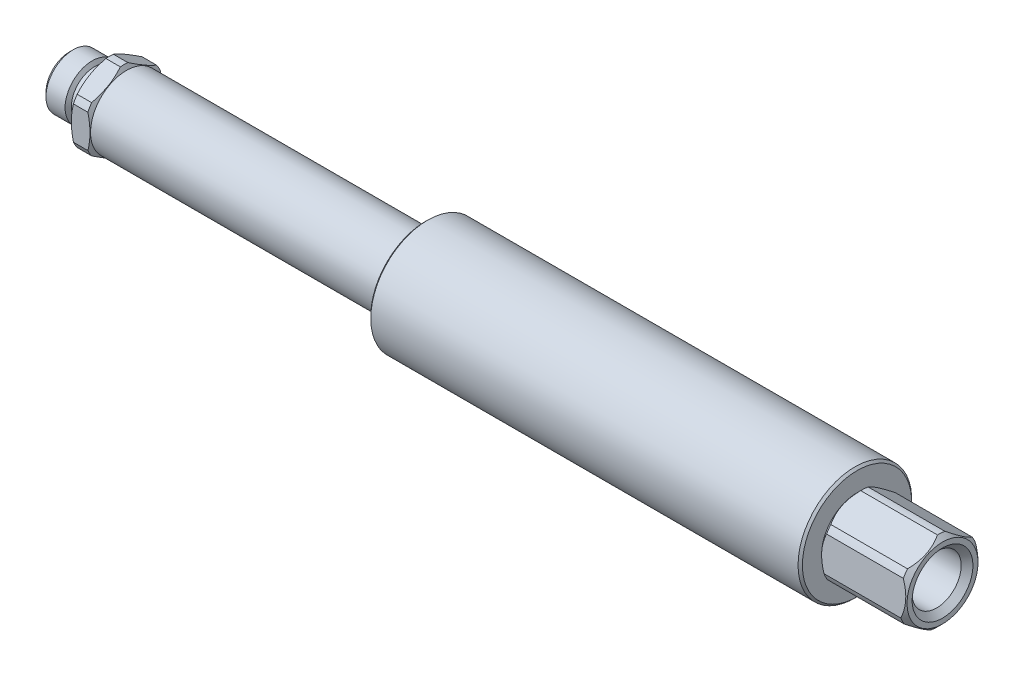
ISO-10303-21;
HEADER;
FILE_DESCRIPTION(('STEP AP214'),'2;1');
FILE_NAME('part.step','',(''),(''),'','','');
FILE_SCHEMA(('AUTOMOTIVE_DESIGN { 1 0 10303 214 1 1 1 1 }'));
ENDSEC;
DATA;
#1=APPLICATION_CONTEXT('core data for automotive mechanical design processes');
#2=APPLICATION_PROTOCOL_DEFINITION('international standard','automotive_design',2000,#1);
#3=PRODUCT_CONTEXT('',#1,'mechanical');
#4=PRODUCT('Part','Part','',(#3));
#5=PRODUCT_RELATED_PRODUCT_CATEGORY('part','',(#4));
#6=PRODUCT_DEFINITION_FORMATION('','',#4);
#7=PRODUCT_DEFINITION_CONTEXT('part definition',#1,'design');
#8=PRODUCT_DEFINITION('design','',#6,#7);
#9=PRODUCT_DEFINITION_SHAPE('','',#8);
#10=(LENGTH_UNIT() NAMED_UNIT(*) SI_UNIT(.MILLI.,.METRE.));
#11=(NAMED_UNIT(*) PLANE_ANGLE_UNIT() SI_UNIT($,.RADIAN.));
#12=(NAMED_UNIT(*) SI_UNIT($,.STERADIAN.) SOLID_ANGLE_UNIT());
#13=UNCERTAINTY_MEASURE_WITH_UNIT(LENGTH_MEASURE(1.E-05),#10,'distance_accuracy_value','');
#14=(GEOMETRIC_REPRESENTATION_CONTEXT(3) GLOBAL_UNCERTAINTY_ASSIGNED_CONTEXT((#13)) GLOBAL_UNIT_ASSIGNED_CONTEXT((#10,
#11,#12)) REPRESENTATION_CONTEXT('',''));
#15=CARTESIAN_POINT('',(0.,0.,0.));
#16=DIRECTION('',(0.,0.,1.));
#17=DIRECTION('',(1.,0.,0.));
#18=AXIS2_PLACEMENT_3D('',#15,#16,#17);
#19=CARTESIAN_POINT('',(61.2467449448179,30.2808454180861,-14.8887103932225));
#20=DIRECTION('',(-1.,0.,0.));
#21=DIRECTION('',(0.,0.,1.));
#22=AXIS2_PLACEMENT_3D('',#19,#20,#21);
#23=PLANE('',#22);
#24=CARTESIAN_POINT('',(61.2467449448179,25.3913454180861,-14.8887103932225));
#25=DIRECTION('',(-1.,0.,0.));
#26=DIRECTION('',(0.,0.,1.));
#27=AXIS2_PLACEMENT_3D('',#24,#25,#26);
#28=CIRCLE('',#27,9.5885);
#29=CARTESIAN_POINT('',(61.2467449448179,25.3913454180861,-5.30021039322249));
#30=VERTEX_POINT('',#29);
#31=EDGE_CURVE('E915',#30,#30,#28,.F.);
#32=ORIENTED_EDGE('',*,*,#31,.T.);
#33=EDGE_LOOP('',(#32));
#34=FACE_BOUND('',#33,.T.);
#35=CARTESIAN_POINT('',(61.2467449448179,25.3913454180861,-14.8887103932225));
#36=DIRECTION('',(-1.,0.,0.));
#37=DIRECTION('',(0.,0.,1.));
#38=AXIS2_PLACEMENT_3D('',#35,#36,#37);
#39=CIRCLE('',#38,6.223);
#40=CARTESIAN_POINT('',(61.2467449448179,25.3913454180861,-8.6657103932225));
#41=VERTEX_POINT('',#40);
#42=EDGE_CURVE('E10',#41,#41,#39,.F.);
#43=ORIENTED_EDGE('',*,*,#42,.F.);
#44=EDGE_LOOP('',(#43));
#45=FACE_BOUND('',#44,.T.);
#46=ADVANCED_FACE('F15',(#34,#45),#23,.F.);
#47=CARTESIAN_POINT('',(-69.8316376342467,25.3913454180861,-14.8887103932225));
#48=DIRECTION('',(1.,0.,0.));
#49=DIRECTION('',(0.,0.,-1.));
#50=AXIS2_PLACEMENT_3D('',#47,#48,#49);
#51=CONICAL_SURFACE('',#50,6.98499999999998,1.04719755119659);
#52=CARTESIAN_POINT('',(-69.8316376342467,25.3913454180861,-14.8887103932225));
#53=DIRECTION('',(-1.,0.,0.));
#54=DIRECTION('',(0.,0.,1.));
#55=AXIS2_PLACEMENT_3D('',#52,#53,#54);
#56=CIRCLE('',#55,6.98499999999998);
#57=CARTESIAN_POINT('',(-69.8316376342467,22.4814098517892,-21.2387103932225));
#58=VERTEX_POINT('',#57);
#59=CARTESIAN_POINT('',(-69.8316376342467,21.3470518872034,-20.5837885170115));
#60=VERTEX_POINT('',#59);
#61=EDGE_CURVE('E745',#58,#60,#56,.T.);
#62=ORIENTED_EDGE('',*,*,#61,.T.);
#63=CARTESIAN_POINT('',(-69.8314376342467,21.3474675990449,-20.5845085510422));
#64=CARTESIAN_POINT('',(-69.8688146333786,21.269794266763,-20.4499743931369));
#65=CARTESIAN_POINT('',(-69.9038523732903,21.191830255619,-20.3149367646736));
#66=CARTESIAN_POINT('',(-69.96873356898,21.0353410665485,-20.0438895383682));
#67=CARTESIAN_POINT('',(-69.9985754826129,20.9568157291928,-19.9078796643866));
#68=CARTESIAN_POINT('',(-70.0525573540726,20.7991800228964,-19.6348466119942));
#69=CARTESIAN_POINT('',(-70.0766907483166,20.7200690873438,-19.4978224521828));
#70=CARTESIAN_POINT('',(-70.1187285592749,20.5614400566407,-19.2230689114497));
#71=CARTESIAN_POINT('',(-70.1366335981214,20.4819220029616,-19.0853396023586));
#72=CARTESIAN_POINT('',(-70.1655385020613,20.324134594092,-18.8120437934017));
#73=CARTESIAN_POINT('',(-70.1766662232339,20.2458711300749,-18.6764874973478));
#74=CARTESIAN_POINT('',(-70.1923035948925,20.0891794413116,-18.405089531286));
#75=CARTESIAN_POINT('',(-70.196813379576,20.0107512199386,-18.2692478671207));
#76=CARTESIAN_POINT('',(-70.1991074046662,19.8539277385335,-17.9976216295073));
#77=CARTESIAN_POINT('',(-70.1968965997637,19.7755324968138,-17.8618370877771));
#78=CARTESIAN_POINT('',(-70.1858137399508,19.6188666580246,-17.5904838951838));
#79=CARTESIAN_POINT('',(-70.1769421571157,19.5405960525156,-17.454915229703));
#80=CARTESIAN_POINT('',(-70.1515316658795,19.3764907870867,-17.1706765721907));
#81=CARTESIAN_POINT('',(-70.1343147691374,19.2906823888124,-17.0220520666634));
#82=CARTESIAN_POINT('',(-70.0925167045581,19.1195107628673,-16.7255741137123));
#83=CARTESIAN_POINT('',(-70.0679348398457,19.0341475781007,-16.5777207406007));
#84=CARTESIAN_POINT('',(-70.0116797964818,18.8630389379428,-16.2813518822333));
#85=CARTESIAN_POINT('',(-69.9799308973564,18.7772997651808,-16.1328472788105));
#86=CARTESIAN_POINT('',(-69.9101938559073,18.6064913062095,-15.8369983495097));
#87=CARTESIAN_POINT('',(-69.8722081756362,18.5214217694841,-15.689653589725));
#88=CARTESIAN_POINT('',(-69.8314376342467,18.436700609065,-15.5429122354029));
#89=B_SPLINE_CURVE_WITH_KNOTS('',3,(#63,#64,#65,#66,#67,#68,#69,#70,#71,#72,#73,#74,#75,#76,#77,
#78,#79,#80,#81,#82,#83,#84,#85,#86,#87,#88),.UNSPECIFIED.,.F.,.F.,(4,2,2,2,2,2,2,2,2,2,2,2,4),
(0.,0.47934850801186,0.958839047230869,1.43887824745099,1.91886948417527,2.38949984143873,
2.86012065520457,3.33039459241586,3.80063520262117,4.31789760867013,4.83520897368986,
5.35826531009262,5.8811156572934),.UNSPECIFIED.);
#90=CARTESIAN_POINT('',(-70.1982550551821,19.8920841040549,-18.0637103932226));
#91=VERTEX_POINT('',#90);
#92=EDGE_CURVE('E898',#60,#91,#89,.T.);
#93=ORIENTED_EDGE('',*,*,#92,.T.);
#94=CARTESIAN_POINT('',(-70.1982550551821,25.3913454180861,-14.8887103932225));
#95=DIRECTION('',(-1.,0.,0.));
#96=DIRECTION('',(0.,0.,1.));
#97=AXIS2_PLACEMENT_3D('',#94,#95,#96);
#98=CIRCLE('',#97,6.34999999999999);
#99=CARTESIAN_POINT('',(-70.1982550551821,25.3913454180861,-21.2387103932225));
#100=VERTEX_POINT('',#99);
#101=EDGE_CURVE('E750',#100,#91,#98,.T.);
#102=ORIENTED_EDGE('',*,*,#101,.F.);
#103=CARTESIAN_POINT('',(-67.2477475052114,15.8509611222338,-21.2387103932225));
#104=CARTESIAN_POINT('',(-67.381045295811,16.1283891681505,-21.2387103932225));
#105=CARTESIAN_POINT('',(-67.5129607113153,16.4064942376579,-21.2387103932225));
#106=CARTESIAN_POINT('',(-67.7732323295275,16.9644254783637,-21.2387103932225));
#107=CARTESIAN_POINT('',(-67.9015878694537,17.2442519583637,-21.2387103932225));
#108=CARTESIAN_POINT('',(-68.1546619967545,17.8075972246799,-21.2387103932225));
#109=CARTESIAN_POINT('',(-68.2793537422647,18.0911281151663,-21.2387103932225));
#110=CARTESIAN_POINT('',(-68.5231112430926,18.6605888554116,-21.2387103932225));
#111=CARTESIAN_POINT('',(-68.6421773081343,18.9465185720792,-21.2387103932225));
#112=CARTESIAN_POINT('',(-68.8742419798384,19.5239121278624,-21.2387103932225));
#113=CARTESIAN_POINT('',(-68.9871744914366,19.8154026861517,-21.2387103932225));
#114=CARTESIAN_POINT('',(-69.2037294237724,20.4018854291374,-21.2387103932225));
#115=CARTESIAN_POINT('',(-69.3073507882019,20.6968780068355,-21.2387103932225));
#116=CARTESIAN_POINT('',(-69.5023641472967,21.2901680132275,-21.2387103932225));
#117=CARTESIAN_POINT('',(-69.5937838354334,21.5884562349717,-21.2387103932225));
#118=CARTESIAN_POINT('',(-69.7613095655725,22.1892487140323,-21.2387103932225));
#119=CARTESIAN_POINT('',(-69.8374206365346,22.4917515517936,-21.2387103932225));
#120=CARTESIAN_POINT('',(-69.9705293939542,23.1012982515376,-21.2387103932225));
#121=CARTESIAN_POINT('',(-70.0275123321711,23.4083454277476,-21.2387103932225));
#122=CARTESIAN_POINT('',(-70.0956887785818,23.8714571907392,-21.2387103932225));
#123=CARTESIAN_POINT('',(-70.1155327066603,24.0262713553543,-21.2387103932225));
#124=CARTESIAN_POINT('',(-70.1490615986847,24.3365597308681,-21.2387103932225));
#125=CARTESIAN_POINT('',(-70.1627471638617,24.4920338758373,-21.2387103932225));
#126=CARTESIAN_POINT('',(-70.1835993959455,24.8025542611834,-21.2387103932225));
#127=CARTESIAN_POINT('',(-70.1908017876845,24.9575980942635,-21.2387103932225));
#128=CARTESIAN_POINT('',(-70.1986535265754,25.2678507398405,-21.2387103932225));
#129=CARTESIAN_POINT('',(-70.1993029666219,25.4230595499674,-21.2387103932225));
#130=CARTESIAN_POINT('',(-70.1940335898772,25.7333261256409,-21.2387103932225));
#131=CARTESIAN_POINT('',(-70.1881164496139,25.8883839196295,-21.2387103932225));
#132=CARTESIAN_POINT('',(-70.1698548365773,26.1981229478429,-21.2387103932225));
#133=CARTESIAN_POINT('',(-70.1575099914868,26.3528041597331,-21.2387103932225));
#134=CARTESIAN_POINT('',(-70.1194508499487,26.7336550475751,-21.2387103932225));
#135=CARTESIAN_POINT('',(-70.0901853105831,26.9594761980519,-21.2387103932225));
#136=CARTESIAN_POINT('',(-70.0196299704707,27.4092235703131,-21.2387103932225));
#137=CARTESIAN_POINT('',(-69.9783382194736,27.6331494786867,-21.2387103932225));
#138=CARTESIAN_POINT('',(-69.8385100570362,28.3025384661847,-21.2387103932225));
#139=CARTESIAN_POINT('',(-69.7241207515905,28.7447217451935,-21.2387103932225));
#140=CARTESIAN_POINT('',(-69.5284796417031,29.4057812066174,-21.2387103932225));
#141=CARTESIAN_POINT('',(-69.4583656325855,29.6281480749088,-21.2387103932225));
#142=CARTESIAN_POINT('',(-69.3115406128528,30.0707346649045,-21.2387103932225));
#143=CARTESIAN_POINT('',(-69.2348290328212,30.2909541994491,-21.2387103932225));
#144=CARTESIAN_POINT('',(-69.0764220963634,30.7281416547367,-21.2387103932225));
#145=CARTESIAN_POINT('',(-68.9947579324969,30.9451209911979,-21.2387103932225));
#146=CARTESIAN_POINT('',(-68.8269563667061,31.3772631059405,-21.2387103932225));
#147=CARTESIAN_POINT('',(-68.7408204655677,31.5924264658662,-21.2387103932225));
#148=CARTESIAN_POINT('',(-68.6528734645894,31.8068299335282,-21.2387103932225));
#149=B_SPLINE_CURVE_WITH_KNOTS('',3,(#103,#104,#105,#106,#107,#108,#109,#110,#111,#112,#113,
#114,#115,#116,#117,#118,#119,#120,#121,#122,#123,#124,#125,#126,#127,#128,#129,#130,#131,#132,
#133,#134,#135,#136,#137,#138,#139,#140,#141,#142,#143,#144,#145,#146,#147,#148),.UNSPECIFIED.,
.F.,.F.,(4,2,2,2,2,2,2,2,2,2,2,2,2,2,2,2,2,2,2,2,2,2,4),(0.,0.923383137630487,1.84693705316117,
2.77610339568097,3.7052185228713,4.64290363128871,5.58069498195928,6.51632030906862,
7.45163777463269,8.38767474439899,8.85581367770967,9.32390689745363,9.78940466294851,
10.2548958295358,10.720268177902,11.1856674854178,11.8684042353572,12.5512517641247,
13.9196249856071,14.6190523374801,15.3185401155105,16.0140058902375,16.7092397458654),.UNSPECIFIED.);
#150=EDGE_CURVE('E614',#100,#58,#149,.F.);
#151=ORIENTED_EDGE('',*,*,#150,.T.);
#152=EDGE_LOOP('',(#62,#93,#102,#151));
#153=FACE_BOUND('',#152,.T.);
#154=ADVANCED_FACE('F513',(#153),#51,.T.);
#155=CARTESIAN_POINT('',(-76.9292550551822,25.3913454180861,-14.8887103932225));
#156=DIRECTION('',(-1.,0.,0.));
#157=DIRECTION('',(0.,0.,1.));
#158=AXIS2_PLACEMENT_3D('',#155,#156,#157);
#159=CYLINDRICAL_SURFACE('',#158,6.98499999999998);
#160=CARTESIAN_POINT('',(-67.2995342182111,25.3913454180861,-14.8887103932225));
#161=DIRECTION('',(-1.,0.,0.));
#162=DIRECTION('',(0.,0.,1.));
#163=AXIS2_PLACEMENT_3D('',#160,#161,#162);
#164=CIRCLE('',#163,6.98499999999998);
#165=CARTESIAN_POINT('',(-67.2995342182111,22.4814098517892,-21.2387103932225));
#166=VERTEX_POINT('',#165);
#167=CARTESIAN_POINT('',(-67.2995342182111,21.3470518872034,-20.5837885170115));
#168=VERTEX_POINT('',#167);
#169=EDGE_CURVE('E741',#166,#168,#164,.T.);
#170=ORIENTED_EDGE('',*,*,#169,.T.);
#171=DIRECTION('',(-1.,0.,0.));
#172=VECTOR('',#171,1.);
#173=CARTESIAN_POINT('',(-76.9292550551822,21.3470518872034,-20.5837885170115));
#174=LINE('',#173,#172);
#175=EDGE_CURVE('E36',#168,#60,#174,.T.);
#176=ORIENTED_EDGE('',*,*,#175,.T.);
#177=ORIENTED_EDGE('',*,*,#61,.F.);
#178=DIRECTION('',(-1.,0.,0.));
#179=VECTOR('',#178,1.);
#180=CARTESIAN_POINT('',(-76.9292550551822,22.4814098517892,-21.2387103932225));
#181=LINE('',#180,#179);
#182=EDGE_CURVE('E699',#58,#166,#181,.F.);
#183=ORIENTED_EDGE('',*,*,#182,.T.);
#184=EDGE_LOOP('',(#170,#176,#177,#183));
#185=FACE_BOUND('',#184,.T.);
#186=ADVANCED_FACE('F518',(#185),#159,.T.);
#187=CARTESIAN_POINT('',(-70.1982550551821,19.8920841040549,-11.7137103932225));
#188=VERTEX_POINT('',#187);
#189=EDGE_CURVE('E754',#91,#188,#98,.T.);
#190=ORIENTED_EDGE('',*,*,#189,.F.);
#191=CARTESIAN_POINT('',(-69.8316376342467,18.4371163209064,-15.5436322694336));
#192=VERTEX_POINT('',#191);
#193=EDGE_CURVE('E904',#91,#192,#89,.T.);
#194=ORIENTED_EDGE('',*,*,#193,.T.);
#195=CARTESIAN_POINT('',(-69.8316376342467,18.4371163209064,-14.2337885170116));
#196=VERTEX_POINT('',#195);
#197=EDGE_CURVE('E749',#192,#196,#56,.T.);
#198=ORIENTED_EDGE('',*,*,#197,.T.);
#199=CARTESIAN_POINT('',(-69.8314376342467,18.436700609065,-14.2345085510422));
#200=CARTESIAN_POINT('',(-69.8688146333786,18.5143739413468,-14.0999743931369));
#201=CARTESIAN_POINT('',(-69.9038523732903,18.5923379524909,-13.9649367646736));
#202=CARTESIAN_POINT('',(-69.96873356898,18.7488271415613,-13.6938895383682));
#203=CARTESIAN_POINT('',(-69.9985754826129,18.8273524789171,-13.5578796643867));
#204=CARTESIAN_POINT('',(-70.0525573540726,18.9849881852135,-13.2848466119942));
#205=CARTESIAN_POINT('',(-70.0766907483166,19.0640991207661,-13.1478224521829));
#206=CARTESIAN_POINT('',(-70.1187285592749,19.2227281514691,-12.8730689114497));
#207=CARTESIAN_POINT('',(-70.1366335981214,19.3022462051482,-12.7353396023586));
#208=CARTESIAN_POINT('',(-70.1655385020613,19.4600336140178,-12.4620437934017));
#209=CARTESIAN_POINT('',(-70.1766662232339,19.5382970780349,-12.3264874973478));
#210=CARTESIAN_POINT('',(-70.1923035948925,19.6949887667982,-12.055089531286));
#211=CARTESIAN_POINT('',(-70.196813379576,19.7734169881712,-11.9192478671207));
#212=CARTESIAN_POINT('',(-70.1991074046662,19.9302404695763,-11.6476216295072));
#213=CARTESIAN_POINT('',(-70.1968965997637,20.008635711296,-11.5118370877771));
#214=CARTESIAN_POINT('',(-70.1858137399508,20.1653015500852,-11.2404838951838));
#215=CARTESIAN_POINT('',(-70.1769421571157,20.2435721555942,-11.104915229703));
#216=CARTESIAN_POINT('',(-70.1515316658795,20.407677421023,-10.8206765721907));
#217=CARTESIAN_POINT('',(-70.1343147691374,20.4934858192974,-10.6720520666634));
#218=CARTESIAN_POINT('',(-70.0925167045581,20.6646574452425,-10.3755741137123));
#219=CARTESIAN_POINT('',(-70.0679348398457,20.7500206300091,-10.2277207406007));
#220=CARTESIAN_POINT('',(-70.0116797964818,20.9211292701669,-9.93135188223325));
#221=CARTESIAN_POINT('',(-69.9799308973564,21.006868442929,-9.78284727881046));
#222=CARTESIAN_POINT('',(-69.9101938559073,21.1776769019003,-9.48699834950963));
#223=CARTESIAN_POINT('',(-69.8722081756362,21.2627464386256,-9.33965358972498));
#224=CARTESIAN_POINT('',(-69.8314376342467,21.3474675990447,-9.19291223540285));
#225=B_SPLINE_CURVE_WITH_KNOTS('',3,(#199,#200,#201,#202,#203,#204,#205,#206,#207,#208,#209,
#210,#211,#212,#213,#214,#215,#216,#217,#218,#219,#220,#221,#222,#223,#224),.UNSPECIFIED.,.F.,
.F.,(4,2,2,2,2,2,2,2,2,2,2,2,4),(0.,0.479348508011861,0.958839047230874,1.438878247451,
1.91886948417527,2.38949984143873,2.86012065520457,3.33039459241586,3.80063520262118,
4.31789760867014,4.83520897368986,5.35826531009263,5.88111565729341),.UNSPECIFIED.);
#226=EDGE_CURVE('E599',#196,#188,#225,.T.);
#227=ORIENTED_EDGE('',*,*,#226,.T.);
#228=EDGE_LOOP('',(#190,#194,#198,#227));
#229=FACE_BOUND('',#228,.T.);
#230=ADVANCED_FACE('F521',(#229),#51,.T.);
#231=ORIENTED_EDGE('',*,*,#197,.F.);
#232=DIRECTION('',(-1.,0.,0.));
#233=VECTOR('',#232,1.);
#234=CARTESIAN_POINT('',(-76.9292550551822,18.4371163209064,-15.5436322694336));
#235=LINE('',#234,#233);
#236=CARTESIAN_POINT('',(-67.2995342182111,18.4371163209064,-15.5436322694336));
#237=VERTEX_POINT('',#236);
#238=EDGE_CURVE('E909',#192,#237,#235,.F.);
#239=ORIENTED_EDGE('',*,*,#238,.T.);
#240=CARTESIAN_POINT('',(-67.2995342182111,18.4371163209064,-14.2337885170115));
#241=VERTEX_POINT('',#240);
#242=EDGE_CURVE('E46',#237,#241,#164,.T.);
#243=ORIENTED_EDGE('',*,*,#242,.T.);
#244=DIRECTION('',(-1.,0.,0.));
#245=VECTOR('',#244,1.);
#246=CARTESIAN_POINT('',(-76.9292550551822,18.4371163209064,-14.2337885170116));
#247=LINE('',#246,#245);
#248=EDGE_CURVE('E600',#241,#196,#247,.T.);
#249=ORIENTED_EDGE('',*,*,#248,.T.);
#250=EDGE_LOOP('',(#231,#239,#243,#249));
#251=FACE_BOUND('',#250,.T.);
#252=ADVANCED_FACE('F1365',(#251),#159,.T.);
#253=CARTESIAN_POINT('',(-70.1982550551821,25.391345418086,-8.53871039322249));
#254=VERTEX_POINT('',#253);
#255=EDGE_CURVE('E815',#188,#254,#98,.T.);
#256=ORIENTED_EDGE('',*,*,#255,.F.);
#257=CARTESIAN_POINT('',(-69.8316376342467,21.3470518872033,-9.19363226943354));
#258=VERTEX_POINT('',#257);
#259=EDGE_CURVE('E591',#188,#258,#225,.T.);
#260=ORIENTED_EDGE('',*,*,#259,.T.);
#261=CARTESIAN_POINT('',(-69.8316376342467,22.4814098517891,-8.53871039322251));
#262=VERTEX_POINT('',#261);
#263=EDGE_CURVE('E1027',#258,#262,#56,.T.);
#264=ORIENTED_EDGE('',*,*,#263,.T.);
#265=CARTESIAN_POINT('',(-67.6121152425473,16.619128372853,-8.53871039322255));
#266=CARTESIAN_POINT('',(-67.7334319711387,16.8786123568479,-8.53871039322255));
#267=CARTESIAN_POINT('',(-67.8532955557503,17.138789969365,-8.53871039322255));
#268=CARTESIAN_POINT('',(-68.0893163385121,17.660883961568,-8.53871039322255));
#269=CARTESIAN_POINT('',(-68.2054727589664,17.9228006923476,-8.53871039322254));
#270=CARTESIAN_POINT('',(-68.4339201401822,18.4502147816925,-8.53871039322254));
#271=CARTESIAN_POINT('',(-68.546183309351,18.7157242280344,-8.53871039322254));
#272=CARTESIAN_POINT('',(-68.7649393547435,19.2491016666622,-8.53871039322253));
#273=CARTESIAN_POINT('',(-68.8714325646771,19.5169695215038,-8.53871039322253));
#274=CARTESIAN_POINT('',(-69.0773569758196,20.0559377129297,-8.53871039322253));
#275=CARTESIAN_POINT('',(-69.1767760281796,20.3270427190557,-8.53871039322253));
#276=CARTESIAN_POINT('',(-69.3664612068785,20.8724901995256,-8.53871039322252));
#277=CARTESIAN_POINT('',(-69.4567264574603,21.1468329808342,-8.53871039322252));
#278=CARTESIAN_POINT('',(-69.625505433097,21.6984491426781,-8.53871039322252));
#279=CARTESIAN_POINT('',(-69.7040460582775,21.9757142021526,-8.53871039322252));
#280=CARTESIAN_POINT('',(-69.8467637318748,22.5339037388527,-8.53871039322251));
#281=CARTESIAN_POINT('',(-69.9109437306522,22.8148274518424,-8.53871039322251));
#282=CARTESIAN_POINT('',(-70.0254574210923,23.3986771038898,-8.53871039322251));
#283=CARTESIAN_POINT('',(-70.0746102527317,23.7018399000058,-8.5387103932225));
#284=CARTESIAN_POINT('',(-70.1495520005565,24.3111219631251,-8.5387103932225));
#285=CARTESIAN_POINT('',(-70.1753401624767,24.6172413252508,-8.5387103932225));
#286=CARTESIAN_POINT('',(-70.2012863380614,25.2295280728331,-8.53871039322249));
#287=CARTESIAN_POINT('',(-70.2015329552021,25.5356916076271,-8.53871039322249));
#288=CARTESIAN_POINT('',(-70.1765922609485,26.1469107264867,-8.53871039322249));
#289=CARTESIAN_POINT('',(-70.1514092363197,26.4519664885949,-8.53871039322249));
#290=CARTESIAN_POINT('',(-70.0859129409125,26.9922141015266,-8.53871039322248));
#291=CARTESIAN_POINT('',(-70.0501593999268,27.227981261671,-8.53871039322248));
#292=CARTESIAN_POINT('',(-69.9661319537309,27.6973026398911,-8.53871039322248));
#293=CARTESIAN_POINT('',(-69.917855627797,27.9308564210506,-8.53871039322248));
#294=CARTESIAN_POINT('',(-69.8104343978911,28.3959564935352,-8.53871039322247));
#295=CARTESIAN_POINT('',(-69.7512660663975,28.627497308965,-8.53871039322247));
#296=CARTESIAN_POINT('',(-69.623854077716,29.0880742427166,-8.53871039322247));
#297=CARTESIAN_POINT('',(-69.5556094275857,29.317110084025,-8.53871039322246));
#298=CARTESIAN_POINT('',(-69.4103265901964,29.7768047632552,-8.53871039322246));
#299=CARTESIAN_POINT('',(-69.3331545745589,30.007421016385,-8.53871039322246));
#300=CARTESIAN_POINT('',(-69.1723949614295,30.4664145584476,-8.53871039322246));
#301=CARTESIAN_POINT('',(-69.088806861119,30.6947916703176,-8.53871039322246));
#302=CARTESIAN_POINT('',(-68.9168844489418,31.1481858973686,-8.53871039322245));
#303=CARTESIAN_POINT('',(-68.8285813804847,31.373214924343,-8.53871039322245));
#304=CARTESIAN_POINT('',(-68.6476774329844,31.8214621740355,-8.53871039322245));
#305=CARTESIAN_POINT('',(-68.5550778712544,32.0446809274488,-8.53871039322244));
#306=CARTESIAN_POINT('',(-68.4607525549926,32.2671483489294,-8.53871039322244));
#307=B_SPLINE_CURVE_WITH_KNOTS('',3,(#265,#266,#267,#268,#269,#270,#271,#272,#273,#274,#275,
#276,#277,#278,#279,#280,#281,#282,#283,#284,#285,#286,#287,#288,#289,#290,#291,#292,#293,#294,
#295,#296,#297,#298,#299,#300,#301,#302,#303,#304,#305,#306),.UNSPECIFIED.,.F.,.F.,(4,2,2,2,2,2,
2,2,2,2,2,2,2,2,2,2,2,2,2,2,4),(0.,0.859344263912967,1.71886763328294,2.58361620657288,
3.44831471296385,4.31446406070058,5.18069619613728,6.0449093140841,6.90894471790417,
7.82951924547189,8.75012349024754,9.66753405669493,10.5847899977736,11.2998222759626,
12.0149928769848,12.7317200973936,13.4485257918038,14.1779698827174,14.9074711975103,
15.6326263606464,16.357560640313),.UNSPECIFIED.);
#308=EDGE_CURVE('E646',#262,#254,#307,.T.);
#309=ORIENTED_EDGE('',*,*,#308,.T.);
#310=EDGE_LOOP('',(#256,#260,#264,#309));
#311=FACE_BOUND('',#310,.T.);
#312=ADVANCED_FACE('F816',(#311),#51,.T.);
#313=ORIENTED_EDGE('',*,*,#263,.F.);
#314=DIRECTION('',(-1.,0.,0.));
#315=VECTOR('',#314,1.);
#316=CARTESIAN_POINT('',(-76.9292550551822,21.3470518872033,-9.19363226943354));
#317=LINE('',#316,#315);
#318=CARTESIAN_POINT('',(-67.2995342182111,21.3470518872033,-9.19363226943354));
#319=VERTEX_POINT('',#318);
#320=EDGE_CURVE('E895',#258,#319,#317,.F.);
#321=ORIENTED_EDGE('',*,*,#320,.T.);
#322=CARTESIAN_POINT('',(-67.2995342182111,22.4814098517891,-8.53871039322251));
#323=VERTEX_POINT('',#322);
#324=EDGE_CURVE('E790',#319,#323,#164,.T.);
#325=ORIENTED_EDGE('',*,*,#324,.T.);
#326=DIRECTION('',(-1.,0.,0.));
#327=VECTOR('',#326,1.);
#328=CARTESIAN_POINT('',(-76.9292550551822,22.4814098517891,-8.53871039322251));
#329=LINE('',#328,#327);
#330=EDGE_CURVE('E647',#323,#262,#329,.T.);
#331=ORIENTED_EDGE('',*,*,#330,.T.);
#332=EDGE_LOOP('',(#313,#321,#325,#331));
#333=FACE_BOUND('',#332,.T.);
#334=ADVANCED_FACE('F1348',(#333),#159,.T.);
#335=CARTESIAN_POINT('',(-70.1982550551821,30.8906067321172,-11.7137103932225));
#336=VERTEX_POINT('',#335);
#337=EDGE_CURVE('E819',#254,#336,#98,.T.);
#338=ORIENTED_EDGE('',*,*,#337,.F.);
#339=CARTESIAN_POINT('',(-69.8316376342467,28.301280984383,-8.53871039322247));
#340=VERTEX_POINT('',#339);
#341=EDGE_CURVE('E639',#254,#340,#307,.T.);
#342=ORIENTED_EDGE('',*,*,#341,.T.);
#343=CARTESIAN_POINT('',(-69.8316376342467,29.4356389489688,-9.19363226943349));
#344=VERTEX_POINT('',#343);
#345=EDGE_CURVE('E799',#340,#344,#56,.T.);
#346=ORIENTED_EDGE('',*,*,#345,.T.);
#347=CARTESIAN_POINT('',(-69.8314376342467,29.4352232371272,-9.19291223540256));
#348=CARTESIAN_POINT('',(-69.8688146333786,29.5128965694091,-9.32744639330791));
#349=CARTESIAN_POINT('',(-69.9038523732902,29.5908605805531,-9.46248402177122));
#350=CARTESIAN_POINT('',(-69.96873356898,29.7473497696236,-9.73353124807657));
#351=CARTESIAN_POINT('',(-69.9985754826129,29.8258751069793,-9.86954112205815));
#352=CARTESIAN_POINT('',(-70.0525573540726,29.9835108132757,-10.1425741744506));
#353=CARTESIAN_POINT('',(-70.0766907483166,30.0626217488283,-10.2795983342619));
#354=CARTESIAN_POINT('',(-70.1187285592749,30.2212507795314,-10.5543518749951));
#355=CARTESIAN_POINT('',(-70.1366335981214,30.3007688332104,-10.6920811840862));
#356=CARTESIAN_POINT('',(-70.1655385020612,30.4585562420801,-10.9653769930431));
#357=CARTESIAN_POINT('',(-70.1766662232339,30.5368197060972,-11.100933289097));
#358=CARTESIAN_POINT('',(-70.1923035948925,30.6935113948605,-11.3723312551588));
#359=CARTESIAN_POINT('',(-70.196813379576,30.7719396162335,-11.5081729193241));
#360=CARTESIAN_POINT('',(-70.1991074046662,30.9287630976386,-11.7797991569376));
#361=CARTESIAN_POINT('',(-70.1968965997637,31.0071583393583,-11.9155836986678));
#362=CARTESIAN_POINT('',(-70.1858137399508,31.1638241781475,-12.186936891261));
#363=CARTESIAN_POINT('',(-70.1769421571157,31.2420947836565,-12.3225055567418));
#364=CARTESIAN_POINT('',(-70.1515316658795,31.4062000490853,-12.6067442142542));
#365=CARTESIAN_POINT('',(-70.1343147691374,31.4920084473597,-12.7553687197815));
#366=CARTESIAN_POINT('',(-70.0925167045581,31.6631800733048,-13.0518466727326));
#367=CARTESIAN_POINT('',(-70.0679348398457,31.7485432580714,-13.1997000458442));
#368=CARTESIAN_POINT('',(-70.0116797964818,31.9196518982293,-13.4960689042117));
#369=CARTESIAN_POINT('',(-69.9799308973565,32.0053910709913,-13.6445735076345));
#370=CARTESIAN_POINT('',(-69.9101938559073,32.1761995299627,-13.9404224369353));
#371=CARTESIAN_POINT('',(-69.8722081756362,32.261269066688,-14.08776719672));
#372=CARTESIAN_POINT('',(-69.8314376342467,32.3459902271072,-14.2345085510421));
#373=B_SPLINE_CURVE_WITH_KNOTS('',3,(#347,#348,#349,#350,#351,#352,#353,#354,#355,#356,#357,
#358,#359,#360,#361,#362,#363,#364,#365,#366,#367,#368,#369,#370,#371,#372),.UNSPECIFIED.,.F.,
.F.,(4,2,2,2,2,2,2,2,2,2,2,2,4),(0.,0.479348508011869,0.958839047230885,1.43887824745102,
1.9188694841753,2.38949984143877,2.86012065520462,3.33039459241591,3.80063520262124,
4.31789760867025,4.83520897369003,5.35826531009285,5.88111565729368),.UNSPECIFIED.);
#374=EDGE_CURVE('E662',#344,#336,#373,.T.);
#375=ORIENTED_EDGE('',*,*,#374,.T.);
#376=EDGE_LOOP('',(#338,#342,#346,#375));
#377=FACE_BOUND('',#376,.T.);
#378=ADVANCED_FACE('F1339',(#377),#51,.T.);
#379=ORIENTED_EDGE('',*,*,#345,.F.);
#380=DIRECTION('',(-1.,0.,0.));
#381=VECTOR('',#380,1.);
#382=CARTESIAN_POINT('',(-76.9292550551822,28.301280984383,-8.53871039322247));
#383=LINE('',#382,#381);
#384=CARTESIAN_POINT('',(-67.2995342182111,28.301280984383,-8.53871039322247));
#385=VERTEX_POINT('',#384);
#386=EDGE_CURVE('E602',#340,#385,#383,.F.);
#387=ORIENTED_EDGE('',*,*,#386,.T.);
#388=CARTESIAN_POINT('',(-67.2995342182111,29.4356389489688,-9.19363226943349));
#389=VERTEX_POINT('',#388);
#390=EDGE_CURVE('E791',#385,#389,#164,.T.);
#391=ORIENTED_EDGE('',*,*,#390,.T.);
#392=DIRECTION('',(-1.,0.,0.));
#393=VECTOR('',#392,1.);
#394=CARTESIAN_POINT('',(-76.9292550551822,29.4356389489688,-9.19363226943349));
#395=LINE('',#394,#393);
#396=EDGE_CURVE('E651',#389,#344,#395,.T.);
#397=ORIENTED_EDGE('',*,*,#396,.T.);
#398=EDGE_LOOP('',(#379,#387,#391,#397));
#399=FACE_BOUND('',#398,.T.);
#400=ADVANCED_FACE('F798',(#399),#159,.T.);
#401=CARTESIAN_POINT('',(-70.1982550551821,30.8906067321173,-18.0637103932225));
#402=VERTEX_POINT('',#401);
#403=EDGE_CURVE('E822',#336,#402,#98,.T.);
#404=ORIENTED_EDGE('',*,*,#403,.F.);
#405=CARTESIAN_POINT('',(-69.8316376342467,32.3455745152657,-14.2337885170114));
#406=VERTEX_POINT('',#405);
#407=EDGE_CURVE('E632',#336,#406,#373,.T.);
#408=ORIENTED_EDGE('',*,*,#407,.T.);
#409=CARTESIAN_POINT('',(-69.8316376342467,32.3455745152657,-15.5436322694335));
#410=VERTEX_POINT('',#409);
#411=EDGE_CURVE('E845',#406,#410,#56,.T.);
#412=ORIENTED_EDGE('',*,*,#411,.T.);
#413=CARTESIAN_POINT('',(-69.8314376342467,32.3459902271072,-15.5429122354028));
#414=CARTESIAN_POINT('',(-69.8688146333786,32.2683168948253,-15.6774463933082));
#415=CARTESIAN_POINT('',(-69.9038523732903,32.1903528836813,-15.8124840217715));
#416=CARTESIAN_POINT('',(-69.96873356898,32.0338636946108,-16.0835312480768));
#417=CARTESIAN_POINT('',(-69.9985754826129,31.9553383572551,-16.2195411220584));
#418=CARTESIAN_POINT('',(-70.0525573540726,31.7977026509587,-16.4925741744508));
#419=CARTESIAN_POINT('',(-70.0766907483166,31.7185917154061,-16.6295983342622));
#420=CARTESIAN_POINT('',(-70.1187285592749,31.559962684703,-16.9043518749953));
#421=CARTESIAN_POINT('',(-70.1366335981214,31.480444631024,-17.0420811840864));
#422=CARTESIAN_POINT('',(-70.1655385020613,31.3226572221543,-17.3153769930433));
#423=CARTESIAN_POINT('',(-70.1766662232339,31.2443937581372,-17.4509332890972));
#424=CARTESIAN_POINT('',(-70.1923035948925,31.0877020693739,-17.722331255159));
#425=CARTESIAN_POINT('',(-70.196813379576,31.0092738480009,-17.8581729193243));
#426=CARTESIAN_POINT('',(-70.1991074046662,30.8524503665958,-18.1297991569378));
#427=CARTESIAN_POINT('',(-70.1968965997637,30.7740551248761,-18.265583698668));
#428=CARTESIAN_POINT('',(-70.1858137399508,30.6173892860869,-18.5369368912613));
#429=CARTESIAN_POINT('',(-70.1769421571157,30.5391186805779,-18.672505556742));
#430=CARTESIAN_POINT('',(-70.1515316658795,30.3750134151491,-18.9567442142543));
#431=CARTESIAN_POINT('',(-70.1343147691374,30.2892050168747,-19.1053687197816));
#432=CARTESIAN_POINT('',(-70.0925167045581,30.1180333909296,-19.4018466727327));
#433=CARTESIAN_POINT('',(-70.0679348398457,30.0326702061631,-19.5497000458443));
#434=CARTESIAN_POINT('',(-70.0116797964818,29.8615615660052,-19.8460689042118));
#435=CARTESIAN_POINT('',(-69.9799308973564,29.7758223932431,-19.9945735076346));
#436=CARTESIAN_POINT('',(-69.9101938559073,29.6050139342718,-20.2904224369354));
#437=CARTESIAN_POINT('',(-69.8722081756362,29.5199443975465,-20.43776719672));
#438=CARTESIAN_POINT('',(-69.8314376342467,29.4352232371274,-20.5845085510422));
#439=B_SPLINE_CURVE_WITH_KNOTS('',3,(#413,#414,#415,#416,#417,#418,#419,#420,#421,#422,#423,
#424,#425,#426,#427,#428,#429,#430,#431,#432,#433,#434,#435,#436,#437,#438),.UNSPECIFIED.,.F.,
.F.,(4,2,2,2,2,2,2,2,2,2,2,2,4),(0.,0.479348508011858,0.958839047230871,1.438878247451,
1.91886948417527,2.38949984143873,2.86012065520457,3.33039459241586,3.80063520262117,
4.31789760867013,4.83520897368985,5.35826531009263,5.88111565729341),.UNSPECIFIED.);
#440=EDGE_CURVE('E692',#410,#402,#439,.T.);
#441=ORIENTED_EDGE('',*,*,#440,.T.);
#442=EDGE_LOOP('',(#404,#408,#412,#441));
#443=FACE_BOUND('',#442,.T.);
#444=ADVANCED_FACE('F609',(#443),#51,.T.);
#445=ORIENTED_EDGE('',*,*,#411,.F.);
#446=DIRECTION('',(-1.,0.,0.));
#447=VECTOR('',#446,1.);
#448=CARTESIAN_POINT('',(-76.9292550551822,32.3455745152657,-14.2337885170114));
#449=LINE('',#448,#447);
#450=CARTESIAN_POINT('',(-67.2995342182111,32.3455745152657,-14.2337885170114));
#451=VERTEX_POINT('',#450);
#452=EDGE_CURVE('E648',#406,#451,#449,.F.);
#453=ORIENTED_EDGE('',*,*,#452,.T.);
#454=CARTESIAN_POINT('',(-67.2995342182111,32.3455745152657,-15.5436322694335));
#455=VERTEX_POINT('',#454);
#456=EDGE_CURVE('E739',#451,#455,#164,.T.);
#457=ORIENTED_EDGE('',*,*,#456,.T.);
#458=DIRECTION('',(-1.,0.,0.));
#459=VECTOR('',#458,1.);
#460=CARTESIAN_POINT('',(-76.9292550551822,32.3455745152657,-15.5436322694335));
#461=LINE('',#460,#459);
#462=EDGE_CURVE('E678',#455,#410,#461,.T.);
#463=ORIENTED_EDGE('',*,*,#462,.T.);
#464=EDGE_LOOP('',(#445,#453,#457,#463));
#465=FACE_BOUND('',#464,.T.);
#466=ADVANCED_FACE('F844',(#465),#159,.T.);
#467=CARTESIAN_POINT('',(-76.9292550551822,25.3913454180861,-14.8887103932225));
#468=DIRECTION('',(1.,0.,0.));
#469=DIRECTION('',(0.,0.,-1.));
#470=AXIS2_PLACEMENT_3D('',#467,#468,#469);
#471=PLANE('',#470);
#472=CARTESIAN_POINT('',(-76.9292550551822,25.3913454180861,-14.8887103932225));
#473=DIRECTION('',(1.,0.,0.));
#474=DIRECTION('',(0.,0.,-1.));
#475=AXIS2_PLACEMENT_3D('',#472,#473,#474);
#476=CIRCLE('',#475,2.7686);
#477=CARTESIAN_POINT('',(-76.9292550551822,25.3913454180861,-17.6573103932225));
#478=VERTEX_POINT('',#477);
#479=EDGE_CURVE('E1045',#478,#478,#476,.T.);
#480=ORIENTED_EDGE('',*,*,#479,.T.);
#481=EDGE_LOOP('',(#480));
#482=FACE_BOUND('',#481,.T.);
#483=CARTESIAN_POINT('',(-76.9292550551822,25.3913454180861,-14.8887103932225));
#484=DIRECTION('',(-1.,0.,0.));
#485=DIRECTION('',(0.,0.,1.));
#486=AXIS2_PLACEMENT_3D('',#483,#484,#485);
#487=CIRCLE('',#486,4.064);
#488=CARTESIAN_POINT('',(-76.9292550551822,25.3913454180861,-10.8247103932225));
#489=VERTEX_POINT('',#488);
#490=EDGE_CURVE('E768',#489,#489,#487,.T.);
#491=ORIENTED_EDGE('',*,*,#490,.T.);
#492=EDGE_LOOP('',(#491));
#493=FACE_BOUND('',#492,.T.);
#494=ADVANCED_FACE('F17',(#482,#493),#471,.F.);
#495=CARTESIAN_POINT('',(-76.2307550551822,25.3913454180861,-14.8887103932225));
#496=DIRECTION('',(1.,0.,0.));
#497=DIRECTION('',(0.,0.,-1.));
#498=AXIS2_PLACEMENT_3D('',#495,#496,#497);
#499=CONICAL_SURFACE('',#498,4.76249999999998,0.785398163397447);
#500=ORIENTED_EDGE('',*,*,#490,.F.);
#501=EDGE_LOOP('',(#500));
#502=FACE_BOUND('',#501,.T.);
#503=CARTESIAN_POINT('',(-76.2307550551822,25.3913454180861,-14.8887103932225));
#504=DIRECTION('',(-1.,0.,0.));
#505=DIRECTION('',(0.,0.,1.));
#506=AXIS2_PLACEMENT_3D('',#503,#504,#505);
#507=CIRCLE('',#506,4.76249999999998);
#508=CARTESIAN_POINT('',(-76.2307550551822,25.3913454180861,-10.1262103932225));
#509=VERTEX_POINT('',#508);
#510=EDGE_CURVE('E765',#509,#509,#507,.T.);
#511=ORIENTED_EDGE('',*,*,#510,.T.);
#512=EDGE_LOOP('',(#511));
#513=FACE_BOUND('',#512,.T.);
#514=ADVANCED_FACE('F1301',(#502,#513),#499,.T.);
#515=CARTESIAN_POINT('',(-76.9292550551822,25.3913454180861,-14.8887103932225));
#516=DIRECTION('',(-1.,0.,0.));
#517=DIRECTION('',(0.,0.,1.));
#518=AXIS2_PLACEMENT_3D('',#515,#516,#517);
#519=CYLINDRICAL_SURFACE('',#518,4.76249999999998);
#520=ORIENTED_EDGE('',*,*,#510,.F.);
#521=EDGE_LOOP('',(#520));
#522=FACE_BOUND('',#521,.T.);
#523=CARTESIAN_POINT('',(-72.8875342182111,25.3913454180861,-14.8887103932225));
#524=DIRECTION('',(-1.,0.,0.));
#525=DIRECTION('',(0.,0.,1.));
#526=AXIS2_PLACEMENT_3D('',#523,#524,#525);
#527=CIRCLE('',#526,4.76249999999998);
#528=CARTESIAN_POINT('',(-72.8875342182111,25.3913454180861,-10.1262103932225));
#529=VERTEX_POINT('',#528);
#530=EDGE_CURVE('E762',#529,#529,#527,.T.);
#531=ORIENTED_EDGE('',*,*,#530,.T.);
#532=EDGE_LOOP('',(#531));
#533=FACE_BOUND('',#532,.T.);
#534=ADVANCED_FACE('F1290',(#522,#533),#519,.T.);
#535=CARTESIAN_POINT('',(-72.4842550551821,25.3913454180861,-14.8887103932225));
#536=DIRECTION('',(-1.,0.,0.));
#537=DIRECTION('',(0.,0.,1.));
#538=AXIS2_PLACEMENT_3D('',#535,#536,#537);
#539=CONICAL_SURFACE('',#538,4.06399999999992,1.04719755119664);
#540=ORIENTED_EDGE('',*,*,#530,.F.);
#541=EDGE_LOOP('',(#540));
#542=FACE_BOUND('',#541,.T.);
#543=CARTESIAN_POINT('',(-72.4842550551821,25.3913454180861,-14.8887103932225));
#544=DIRECTION('',(-1.,0.,0.));
#545=DIRECTION('',(0.,0.,1.));
#546=AXIS2_PLACEMENT_3D('',#543,#544,#545);
#547=CIRCLE('',#546,4.06399999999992);
#548=CARTESIAN_POINT('',(-72.4842550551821,25.3913454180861,-10.8247103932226));
#549=VERTEX_POINT('',#548);
#550=EDGE_CURVE('E758',#549,#549,#547,.T.);
#551=ORIENTED_EDGE('',*,*,#550,.T.);
#552=EDGE_LOOP('',(#551));
#553=FACE_BOUND('',#552,.T.);
#554=ADVANCED_FACE('F1280',(#542,#553),#539,.T.);
#555=CARTESIAN_POINT('',(-76.9292550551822,25.3913454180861,-14.8887103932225));
#556=DIRECTION('',(-1.,0.,0.));
#557=DIRECTION('',(0.,0.,1.));
#558=AXIS2_PLACEMENT_3D('',#555,#556,#557);
#559=CYLINDRICAL_SURFACE('',#558,4.06399999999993);
#560=ORIENTED_EDGE('',*,*,#550,.F.);
#561=EDGE_LOOP('',(#560));
#562=FACE_BOUND('',#561,.T.);
#563=CARTESIAN_POINT('',(-70.1982550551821,25.3913454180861,-14.8887103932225));
#564=DIRECTION('',(-1.,0.,0.));
#565=DIRECTION('',(0.,0.,1.));
#566=AXIS2_PLACEMENT_3D('',#563,#564,#565);
#567=CIRCLE('',#566,4.06399999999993);
#568=CARTESIAN_POINT('',(-70.1982550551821,25.3913454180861,-10.8247103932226));
#569=VERTEX_POINT('',#568);
#570=EDGE_CURVE('E753',#569,#569,#567,.T.);
#571=ORIENTED_EDGE('',*,*,#570,.T.);
#572=EDGE_LOOP('',(#571));
#573=FACE_BOUND('',#572,.T.);
#574=ADVANCED_FACE('F1270',(#562,#573),#559,.T.);
#575=CARTESIAN_POINT('',(-70.1982550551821,29.455345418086,-14.8887103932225));
#576=DIRECTION('',(1.,0.,0.));
#577=DIRECTION('',(0.,0.,-1.));
#578=AXIS2_PLACEMENT_3D('',#575,#576,#577);
#579=PLANE('',#578);
#580=ORIENTED_EDGE('',*,*,#570,.F.);
#581=EDGE_LOOP('',(#580));
#582=FACE_BOUND('',#581,.T.);
#583=ORIENTED_EDGE('',*,*,#101,.T.);
#584=ORIENTED_EDGE('',*,*,#189,.T.);
#585=ORIENTED_EDGE('',*,*,#255,.T.);
#586=ORIENTED_EDGE('',*,*,#337,.T.);
#587=ORIENTED_EDGE('',*,*,#403,.T.);
#588=EDGE_CURVE('E748',#402,#100,#98,.T.);
#589=ORIENTED_EDGE('',*,*,#588,.T.);
#590=EDGE_LOOP('',(#583,#584,#585,#586,#587,#589));
#591=FACE_BOUND('',#590,.T.);
#592=ADVANCED_FACE('F607',(#582,#591),#579,.F.);
#593=ORIENTED_EDGE('',*,*,#588,.F.);
#594=CARTESIAN_POINT('',(-69.8316376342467,29.4356389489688,-20.5837885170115));
#595=VERTEX_POINT('',#594);
#596=EDGE_CURVE('E624',#402,#595,#439,.T.);
#597=ORIENTED_EDGE('',*,*,#596,.T.);
#598=CARTESIAN_POINT('',(-69.8316376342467,28.301280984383,-21.2387103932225));
#599=VERTEX_POINT('',#598);
#600=EDGE_CURVE('E744',#595,#599,#56,.T.);
#601=ORIENTED_EDGE('',*,*,#600,.T.);
#602=EDGE_CURVE('E719',#599,#100,#149,.F.);
#603=ORIENTED_EDGE('',*,*,#602,.T.);
#604=EDGE_LOOP('',(#593,#597,#601,#603));
#605=FACE_BOUND('',#604,.T.);
#606=ADVANCED_FACE('F522',(#605),#51,.T.);
#607=ORIENTED_EDGE('',*,*,#600,.F.);
#608=DIRECTION('',(-1.,0.,0.));
#609=VECTOR('',#608,1.);
#610=CARTESIAN_POINT('',(-76.9292550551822,29.4356389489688,-20.5837885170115));
#611=LINE('',#610,#609);
#612=CARTESIAN_POINT('',(-67.2995342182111,29.4356389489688,-20.5837885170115));
#613=VERTEX_POINT('',#612);
#614=EDGE_CURVE('E671',#595,#613,#611,.F.);
#615=ORIENTED_EDGE('',*,*,#614,.T.);
#616=CARTESIAN_POINT('',(-67.2995342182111,28.301280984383,-21.2387103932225));
#617=VERTEX_POINT('',#616);
#618=EDGE_CURVE('E734',#613,#617,#164,.T.);
#619=ORIENTED_EDGE('',*,*,#618,.T.);
#620=DIRECTION('',(-1.,0.,0.));
#621=VECTOR('',#620,1.);
#622=CARTESIAN_POINT('',(-76.9292550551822,28.301280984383,-21.2387103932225));
#623=LINE('',#622,#621);
#624=EDGE_CURVE('E706',#617,#599,#623,.T.);
#625=ORIENTED_EDGE('',*,*,#624,.T.);
#626=EDGE_LOOP('',(#607,#615,#619,#625));
#627=FACE_BOUND('',#626,.T.);
#628=ADVANCED_FACE('F538',(#627),#159,.T.);
#629=CARTESIAN_POINT('',(-66.8962550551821,25.3913454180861,-14.8887103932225));
#630=DIRECTION('',(-1.,0.,0.));
#631=DIRECTION('',(0.,0.,1.));
#632=AXIS2_PLACEMENT_3D('',#629,#630,#631);
#633=CONICAL_SURFACE('',#632,6.28649999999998,1.04719755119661);
#634=ORIENTED_EDGE('',*,*,#242,.F.);
#635=CARTESIAN_POINT('',(-67.2997342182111,18.436700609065,-15.5429122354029));
#636=CARTESIAN_POINT('',(-67.2623572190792,18.5143739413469,-15.6774463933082));
#637=CARTESIAN_POINT('',(-67.2273194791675,18.5923379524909,-15.8124840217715));
#638=CARTESIAN_POINT('',(-67.1624382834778,18.7488271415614,-16.0835312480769));
#639=CARTESIAN_POINT('',(-67.1325963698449,18.8273524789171,-16.2195411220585));
#640=CARTESIAN_POINT('',(-67.0786144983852,18.9849881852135,-16.4925741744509));
#641=CARTESIAN_POINT('',(-67.0544811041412,19.0640991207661,-16.6295983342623));
#642=CARTESIAN_POINT('',(-67.0124432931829,19.2227281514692,-16.9043518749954));
#643=CARTESIAN_POINT('',(-66.9945382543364,19.3022462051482,-17.0420811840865));
#644=CARTESIAN_POINT('',(-66.9656333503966,19.4600336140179,-17.3153769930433));
#645=CARTESIAN_POINT('',(-66.954505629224,19.538297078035,-17.4509332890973));
#646=CARTESIAN_POINT('',(-66.9388682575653,19.6949887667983,-17.7223312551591));
#647=CARTESIAN_POINT('',(-66.9343584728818,19.7734169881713,-17.8581729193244));
#648=CARTESIAN_POINT('',(-66.9320644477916,19.9302404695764,-18.1297991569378));
#649=CARTESIAN_POINT('',(-66.9342752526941,20.0086357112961,-18.265583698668));
#650=CARTESIAN_POINT('',(-66.9453581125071,20.1653015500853,-18.5369368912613));
#651=CARTESIAN_POINT('',(-66.9542296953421,20.2435721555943,-18.6725055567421));
#652=CARTESIAN_POINT('',(-66.9796401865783,20.4076774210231,-18.9567442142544));
#653=CARTESIAN_POINT('',(-66.9968570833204,20.4934858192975,-19.1053687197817));
#654=CARTESIAN_POINT('',(-67.0386551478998,20.6646574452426,-19.4018466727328));
#655=CARTESIAN_POINT('',(-67.0632370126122,20.7500206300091,-19.5497000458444));
#656=CARTESIAN_POINT('',(-67.119492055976,20.921129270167,-19.8460689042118));
#657=CARTESIAN_POINT('',(-67.1512409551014,21.0068684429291,-19.9945735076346));
#658=CARTESIAN_POINT('',(-67.2209779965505,21.1776769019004,-20.2904224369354));
#659=CARTESIAN_POINT('',(-67.2589636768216,21.2627464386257,-20.4377671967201));
#660=CARTESIAN_POINT('',(-67.2997342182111,21.3474675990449,-20.5845085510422));
#661=B_SPLINE_CURVE_WITH_KNOTS('',3,(#635,#636,#637,#638,#639,#640,#641,#642,#643,#644,#645,
#646,#647,#648,#649,#650,#651,#652,#653,#654,#655,#656,#657,#658,#659,#660),.UNSPECIFIED.,.F.,
.F.,(4,2,2,2,2,2,2,2,2,2,2,2,4),(0.,0.479348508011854,0.958839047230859,1.43887824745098,
1.91886948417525,2.38949984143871,2.86012065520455,3.33039459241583,3.80063520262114,
4.31789760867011,4.83520897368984,5.3582653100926,5.8811156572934),.UNSPECIFIED.);
#662=EDGE_CURVE('E24',#237,#168,#661,.T.);
#663=ORIENTED_EDGE('',*,*,#662,.T.);
#664=ORIENTED_EDGE('',*,*,#169,.F.);
#665=CARTESIAN_POINT('',(-69.8811064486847,15.8557841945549,-21.2387103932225));
#666=CARTESIAN_POINT('',(-69.7478461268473,16.1331774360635,-21.2387103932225));
#667=CARTESIAN_POINT('',(-69.6159693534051,16.4112481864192,-21.2387103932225));
#668=CARTESIAN_POINT('',(-69.3557781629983,16.9691120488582,-21.2387103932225));
#669=CARTESIAN_POINT('',(-69.2274644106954,17.2489054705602,-21.2387103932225));
#670=CARTESIAN_POINT('',(-68.9744769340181,17.8121884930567,-21.2387103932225));
#671=CARTESIAN_POINT('',(-68.8498301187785,18.0956902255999,-21.2387103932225));
#672=CARTESIAN_POINT('',(-68.6061678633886,18.665094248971,-21.2387103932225));
#673=CARTESIAN_POINT('',(-68.4871521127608,18.9509964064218,-21.2387103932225));
#674=CARTESIAN_POINT('',(-68.2552050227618,19.528312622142,-21.2387103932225));
#675=CARTESIAN_POINT('',(-68.1423392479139,19.8197531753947,-21.2387103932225));
#676=CARTESIAN_POINT('',(-67.9259250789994,20.4061369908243,-21.2387103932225));
#677=CARTESIAN_POINT('',(-67.8223777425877,20.7010806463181,-21.2387103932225));
#678=CARTESIAN_POINT('',(-67.6275213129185,21.2942721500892,-21.2387103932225));
#679=CARTESIAN_POINT('',(-67.5361844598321,21.5925107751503,-21.2387103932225));
#680=CARTESIAN_POINT('',(-67.3688336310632,22.1932028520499,-21.2387103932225));
#681=CARTESIAN_POINT('',(-67.2928146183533,22.4956548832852,-21.2387103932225));
#682=CARTESIAN_POINT('',(-67.1598973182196,23.1051002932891,-21.2387103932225));
#683=CARTESIAN_POINT('',(-67.1030140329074,23.412097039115,-21.2387103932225));
#684=CARTESIAN_POINT('',(-67.0349901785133,23.8751283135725,-21.2387103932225));
#685=CARTESIAN_POINT('',(-67.015197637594,24.0299148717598,-21.2387103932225));
#686=CARTESIAN_POINT('',(-66.9817715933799,24.3401461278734,-21.2387103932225));
#687=CARTESIAN_POINT('',(-66.9681374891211,24.4955907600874,-21.2387103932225));
#688=CARTESIAN_POINT('',(-66.947386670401,24.8060533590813,-21.2387103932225));
#689=CARTESIAN_POINT('',(-66.9402343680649,24.9610689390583,-21.2387103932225));
#690=CARTESIAN_POINT('',(-66.9324808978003,25.2712629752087,-21.2387103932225));
#691=CARTESIAN_POINT('',(-66.9318796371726,25.4264414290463,-21.2387103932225));
#692=CARTESIAN_POINT('',(-66.9372423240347,25.7366454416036,-21.2387103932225));
#693=CARTESIAN_POINT('',(-66.9432046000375,25.8916710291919,-21.2387103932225));
#694=CARTESIAN_POINT('',(-66.9615525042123,26.2013440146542,-21.2387103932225));
#695=CARTESIAN_POINT('',(-66.9739385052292,26.3559913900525,-21.2387103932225));
#696=CARTESIAN_POINT('',(-67.0121102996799,26.736925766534,-21.2387103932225));
#697=CARTESIAN_POINT('',(-67.0414545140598,26.9628625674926,-21.2387103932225));
#698=CARTESIAN_POINT('',(-67.1121730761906,27.4128369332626,-21.2387103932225));
#699=CARTESIAN_POINT('',(-67.1535493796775,27.6368741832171,-21.2387103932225));
#700=CARTESIAN_POINT('',(-67.2936353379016,28.3065926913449,-21.2387103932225));
#701=CARTESIAN_POINT('',(-67.4082016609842,28.748988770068,-21.2387103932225));
#702=CARTESIAN_POINT('',(-67.6041043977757,29.4103562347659,-21.2387103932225));
#703=CARTESIAN_POINT('',(-67.6743043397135,29.6328208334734,-21.2387103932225));
#704=CARTESIAN_POINT('',(-67.8212991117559,30.0756020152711,-21.2387103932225));
#705=CARTESIAN_POINT('',(-67.898094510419,30.29591841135,-21.2387103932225));
#706=CARTESIAN_POINT('',(-68.0566660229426,30.7332980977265,-21.2387103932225));
#707=CARTESIAN_POINT('',(-68.1384109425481,30.9503728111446,-21.2387103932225));
#708=CARTESIAN_POINT('',(-68.3063717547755,31.3827057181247,-21.2387103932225));
#709=CARTESIAN_POINT('',(-68.3925861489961,31.5979644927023,-21.2387103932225));
#710=CARTESIAN_POINT('',(-68.480610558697,31.8124635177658,-21.2387103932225));
#711=B_SPLINE_CURVE_WITH_KNOTS('',3,(#665,#666,#667,#668,#669,#670,#671,#672,#673,#674,#675,
#676,#677,#678,#679,#680,#681,#682,#683,#684,#685,#686,#687,#688,#689,#690,#691,#692,#693,#694,
#695,#696,#697,#698,#699,#700,#701,#702,#703,#704,#705,#706,#707,#708,#709,#710),.UNSPECIFIED.,
.F.,.F.,(4,2,2,2,2,2,2,2,2,2,2,2,2,2,2,2,2,2,2,2,2,2,4),(0.,0.923240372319,1.84665182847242,
2.77568374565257,3.70466437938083,4.64213707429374,5.57971603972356,6.51512584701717,
7.45022755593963,8.38606067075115,8.85409785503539,9.32208935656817,9.78749553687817,
10.2528951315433,10.7181762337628,11.1834843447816,11.8665952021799,12.5498171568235,
13.9189419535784,14.6187265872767,15.3185716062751,16.0143905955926,16.7099777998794),.UNSPECIFIED.);
#712=EDGE_CURVE('E543',#166,#617,#711,.T.);
#713=ORIENTED_EDGE('',*,*,#712,.T.);
#714=ORIENTED_EDGE('',*,*,#618,.F.);
#715=CARTESIAN_POINT('',(-67.2997342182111,29.4352232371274,-20.5845085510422));
#716=CARTESIAN_POINT('',(-67.2623572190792,29.5128965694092,-20.4499743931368));
#717=CARTESIAN_POINT('',(-67.2273194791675,29.5908605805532,-20.3149367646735));
#718=CARTESIAN_POINT('',(-67.1624382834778,29.7473497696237,-20.0438895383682));
#719=CARTESIAN_POINT('',(-67.1325963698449,29.8258751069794,-19.9078796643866));
#720=CARTESIAN_POINT('',(-67.0786144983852,29.9835108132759,-19.6348466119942));
#721=CARTESIAN_POINT('',(-67.0544811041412,30.0626217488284,-19.4978224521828));
#722=CARTESIAN_POINT('',(-67.0124432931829,30.2212507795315,-19.2230689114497));
#723=CARTESIAN_POINT('',(-66.9945382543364,30.3007688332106,-19.0853396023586));
#724=CARTESIAN_POINT('',(-66.9656333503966,30.4585562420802,-18.8120437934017));
#725=CARTESIAN_POINT('',(-66.954505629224,30.5368197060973,-18.6764874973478));
#726=CARTESIAN_POINT('',(-66.9388682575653,30.6935113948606,-18.4050895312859));
#727=CARTESIAN_POINT('',(-66.9343584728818,30.7719396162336,-18.2692478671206));
#728=CARTESIAN_POINT('',(-66.9320644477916,30.9287630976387,-17.9976216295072));
#729=CARTESIAN_POINT('',(-66.9342752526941,31.0071583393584,-17.861837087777));
#730=CARTESIAN_POINT('',(-66.9453581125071,31.1638241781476,-17.5904838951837));
#731=CARTESIAN_POINT('',(-66.9542296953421,31.2420947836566,-17.454915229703));
#732=CARTESIAN_POINT('',(-66.9796401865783,31.4062000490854,-17.1706765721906));
#733=CARTESIAN_POINT('',(-66.9968570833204,31.4920084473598,-17.0220520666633));
#734=CARTESIAN_POINT('',(-67.0386551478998,31.6631800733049,-16.7255741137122));
#735=CARTESIAN_POINT('',(-67.0632370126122,31.7485432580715,-16.5777207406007));
#736=CARTESIAN_POINT('',(-67.119492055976,31.9196518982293,-16.2813518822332));
#737=CARTESIAN_POINT('',(-67.1512409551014,32.0053910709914,-16.1328472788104));
#738=CARTESIAN_POINT('',(-67.2209779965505,32.1761995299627,-15.8369983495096));
#739=CARTESIAN_POINT('',(-67.2589636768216,32.261269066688,-15.6896535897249));
#740=CARTESIAN_POINT('',(-67.2997342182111,32.3459902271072,-15.5429122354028));
#741=B_SPLINE_CURVE_WITH_KNOTS('',3,(#715,#716,#717,#718,#719,#720,#721,#722,#723,#724,#725,
#726,#727,#728,#729,#730,#731,#732,#733,#734,#735,#736,#737,#738,#739,#740),.UNSPECIFIED.,.F.,
.F.,(4,2,2,2,2,2,2,2,2,2,2,2,4),(0.,0.479348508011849,0.958839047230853,1.43887824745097,
1.91886948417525,2.3894998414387,2.86012065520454,3.33039459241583,3.80063520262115,
4.31789760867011,4.83520897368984,5.35826531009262,5.8811156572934),.UNSPECIFIED.);
#742=EDGE_CURVE('E552',#613,#455,#741,.T.);
#743=ORIENTED_EDGE('',*,*,#742,.T.);
#744=ORIENTED_EDGE('',*,*,#456,.F.);
#745=CARTESIAN_POINT('',(-67.2997342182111,32.3459902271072,-14.2345085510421));
#746=CARTESIAN_POINT('',(-67.2623572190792,32.2683168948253,-14.0999743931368));
#747=CARTESIAN_POINT('',(-67.2273194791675,32.1903528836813,-13.9649367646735));
#748=CARTESIAN_POINT('',(-67.1624382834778,32.0338636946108,-13.6938895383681));
#749=CARTESIAN_POINT('',(-67.1325963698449,31.9553383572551,-13.5578796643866));
#750=CARTESIAN_POINT('',(-67.0786144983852,31.7977026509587,-13.2848466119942));
#751=CARTESIAN_POINT('',(-67.0544811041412,31.7185917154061,-13.1478224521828));
#752=CARTESIAN_POINT('',(-67.0124432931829,31.559962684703,-12.8730689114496));
#753=CARTESIAN_POINT('',(-66.9945382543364,31.480444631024,-12.7353396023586));
#754=CARTESIAN_POINT('',(-66.9656333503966,31.3226572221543,-12.4620437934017));
#755=CARTESIAN_POINT('',(-66.954505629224,31.2443937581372,-12.3264874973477));
#756=CARTESIAN_POINT('',(-66.9388682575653,31.0877020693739,-12.0550895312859));
#757=CARTESIAN_POINT('',(-66.9343584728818,31.0092738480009,-11.9192478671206));
#758=CARTESIAN_POINT('',(-66.9320644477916,30.8524503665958,-11.6476216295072));
#759=CARTESIAN_POINT('',(-66.9342752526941,30.7740551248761,-11.511837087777));
#760=CARTESIAN_POINT('',(-66.9453581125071,30.6173892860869,-11.2404838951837));
#761=CARTESIAN_POINT('',(-66.9542296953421,30.5391186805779,-11.104915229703));
#762=CARTESIAN_POINT('',(-66.9796401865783,30.3750134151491,-10.8206765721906));
#763=CARTESIAN_POINT('',(-66.9968570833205,30.2892050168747,-10.6720520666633));
#764=CARTESIAN_POINT('',(-67.0386551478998,30.1180333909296,-10.3755741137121));
#765=CARTESIAN_POINT('',(-67.0632370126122,30.032670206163,-10.2277207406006));
#766=CARTESIAN_POINT('',(-67.119492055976,29.8615615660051,-9.93135188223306));
#767=CARTESIAN_POINT('',(-67.1512409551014,29.775822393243,-9.78284727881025));
#768=CARTESIAN_POINT('',(-67.2209779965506,29.6050139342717,-9.48699834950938));
#769=CARTESIAN_POINT('',(-67.2589636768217,29.5199443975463,-9.33965358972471));
#770=CARTESIAN_POINT('',(-67.2997342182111,29.4352232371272,-9.19291223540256));
#771=B_SPLINE_CURVE_WITH_KNOTS('',3,(#745,#746,#747,#748,#749,#750,#751,#752,#753,#754,#755,
#756,#757,#758,#759,#760,#761,#762,#763,#764,#765,#766,#767,#768,#769,#770),.UNSPECIFIED.,.F.,
.F.,(4,2,2,2,2,2,2,2,2,2,2,2,4),(0.,0.479348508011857,0.958839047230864,1.43887824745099,
1.91886948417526,2.38949984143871,2.86012065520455,3.33039459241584,3.80063520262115,
4.31789760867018,4.83520897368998,5.35826531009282,5.88111565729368),.UNSPECIFIED.);
#772=EDGE_CURVE('E558',#451,#389,#771,.T.);
#773=ORIENTED_EDGE('',*,*,#772,.T.);
#774=ORIENTED_EDGE('',*,*,#390,.F.);
#775=CARTESIAN_POINT('',(-69.8811064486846,15.8557841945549,-8.53871039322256));
#776=CARTESIAN_POINT('',(-69.7478461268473,16.1331774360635,-8.53871039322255));
#777=CARTESIAN_POINT('',(-69.615969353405,16.4112481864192,-8.53871039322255));
#778=CARTESIAN_POINT('',(-69.3557781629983,16.9691120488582,-8.53871039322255));
#779=CARTESIAN_POINT('',(-69.2274644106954,17.2489054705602,-8.53871039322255));
#780=CARTESIAN_POINT('',(-68.974476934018,17.8121884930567,-8.53871039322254));
#781=CARTESIAN_POINT('',(-68.8498301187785,18.0956902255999,-8.53871039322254));
#782=CARTESIAN_POINT('',(-68.6061678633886,18.665094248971,-8.53871039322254));
#783=CARTESIAN_POINT('',(-68.4871521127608,18.9509964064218,-8.53871039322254));
#784=CARTESIAN_POINT('',(-68.2552050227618,19.528312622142,-8.53871039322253));
#785=CARTESIAN_POINT('',(-68.1423392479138,19.8197531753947,-8.53871039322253));
#786=CARTESIAN_POINT('',(-67.9259250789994,20.4061369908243,-8.53871039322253));
#787=CARTESIAN_POINT('',(-67.8223777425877,20.7010806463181,-8.53871039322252));
#788=CARTESIAN_POINT('',(-67.6275213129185,21.2942721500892,-8.53871039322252));
#789=CARTESIAN_POINT('',(-67.5361844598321,21.5925107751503,-8.53871039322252));
#790=CARTESIAN_POINT('',(-67.3688336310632,22.1932028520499,-8.53871039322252));
#791=CARTESIAN_POINT('',(-67.2928146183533,22.4956548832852,-8.53871039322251));
#792=CARTESIAN_POINT('',(-67.1598973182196,23.1051002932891,-8.53871039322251));
#793=CARTESIAN_POINT('',(-67.1030140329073,23.412097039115,-8.53871039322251));
#794=CARTESIAN_POINT('',(-67.0349901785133,23.8751283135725,-8.5387103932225));
#795=CARTESIAN_POINT('',(-67.015197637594,24.0299148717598,-8.5387103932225));
#796=CARTESIAN_POINT('',(-66.9817715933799,24.3401461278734,-8.5387103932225));
#797=CARTESIAN_POINT('',(-66.9681374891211,24.4955907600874,-8.5387103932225));
#798=CARTESIAN_POINT('',(-66.947386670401,24.8060533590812,-8.5387103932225));
#799=CARTESIAN_POINT('',(-66.9402343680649,24.9610689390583,-8.5387103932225));
#800=CARTESIAN_POINT('',(-66.9324808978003,25.2712629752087,-8.53871039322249));
#801=CARTESIAN_POINT('',(-66.9318796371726,25.4264414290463,-8.53871039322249));
#802=CARTESIAN_POINT('',(-66.9372423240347,25.7366454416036,-8.53871039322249));
#803=CARTESIAN_POINT('',(-66.9432046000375,25.8916710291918,-8.53871039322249));
#804=CARTESIAN_POINT('',(-66.9615525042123,26.2013440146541,-8.53871039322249));
#805=CARTESIAN_POINT('',(-66.9739385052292,26.3559913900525,-8.53871039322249));
#806=CARTESIAN_POINT('',(-67.0121102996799,26.736925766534,-8.53871039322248));
#807=CARTESIAN_POINT('',(-67.0414545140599,26.9628625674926,-8.53871039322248));
#808=CARTESIAN_POINT('',(-67.1121730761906,27.4128369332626,-8.53871039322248));
#809=CARTESIAN_POINT('',(-67.1535493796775,27.6368741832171,-8.53871039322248));
#810=CARTESIAN_POINT('',(-67.2936353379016,28.3065926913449,-8.53871039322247));
#811=CARTESIAN_POINT('',(-67.4082016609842,28.748988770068,-8.53871039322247));
#812=CARTESIAN_POINT('',(-67.6041043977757,29.4103562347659,-8.53871039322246));
#813=CARTESIAN_POINT('',(-67.6743043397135,29.6328208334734,-8.53871039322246));
#814=CARTESIAN_POINT('',(-67.8212991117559,30.0756020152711,-8.53871039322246));
#815=CARTESIAN_POINT('',(-67.898094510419,30.29591841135,-8.53871039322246));
#816=CARTESIAN_POINT('',(-68.0566660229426,30.7332980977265,-8.53871039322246));
#817=CARTESIAN_POINT('',(-68.1384109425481,30.9503728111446,-8.53871039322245));
#818=CARTESIAN_POINT('',(-68.3063717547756,31.3827057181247,-8.53871039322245));
#819=CARTESIAN_POINT('',(-68.3925861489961,31.5979644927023,-8.53871039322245));
#820=CARTESIAN_POINT('',(-68.480610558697,31.8124635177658,-8.53871039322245));
#821=B_SPLINE_CURVE_WITH_KNOTS('',3,(#775,#776,#777,#778,#779,#780,#781,#782,#783,#784,#785,
#786,#787,#788,#789,#790,#791,#792,#793,#794,#795,#796,#797,#798,#799,#800,#801,#802,#803,#804,
#805,#806,#807,#808,#809,#810,#811,#812,#813,#814,#815,#816,#817,#818,#819,#820),.UNSPECIFIED.,
.F.,.F.,(4,2,2,2,2,2,2,2,2,2,2,2,2,2,2,2,2,2,2,2,2,2,4),(0.,0.923240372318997,1.8466518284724,
2.77568374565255,3.70466437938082,4.64213707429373,5.57971603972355,6.51512584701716,
7.45022755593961,8.38606067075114,8.85409785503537,9.32208935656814,9.78749553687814,
10.2528951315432,10.7181762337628,11.1834843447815,11.8665952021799,12.5498171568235,
13.9189419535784,14.6187265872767,15.318571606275,16.0143905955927,16.7099777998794),.UNSPECIFIED.);
#822=EDGE_CURVE('E564',#385,#323,#821,.F.);
#823=ORIENTED_EDGE('',*,*,#822,.T.);
#824=ORIENTED_EDGE('',*,*,#324,.F.);
#825=CARTESIAN_POINT('',(-67.2997342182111,21.3474675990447,-9.19291223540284));
#826=CARTESIAN_POINT('',(-67.2623572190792,21.2697942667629,-9.3274463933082));
#827=CARTESIAN_POINT('',(-67.2273194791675,21.1918302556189,-9.4624840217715));
#828=CARTESIAN_POINT('',(-67.1624382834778,21.0353410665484,-9.73353124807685));
#829=CARTESIAN_POINT('',(-67.1325963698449,20.9568157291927,-9.86954112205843));
#830=CARTESIAN_POINT('',(-67.0786144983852,20.7991800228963,-10.1425741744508));
#831=CARTESIAN_POINT('',(-67.0544811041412,20.7200690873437,-10.2795983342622));
#832=CARTESIAN_POINT('',(-67.0124432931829,20.5614400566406,-10.5543518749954));
#833=CARTESIAN_POINT('',(-66.9945382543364,20.4819220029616,-10.6920811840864));
#834=CARTESIAN_POINT('',(-66.9656333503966,20.3241345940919,-10.9653769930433));
#835=CARTESIAN_POINT('',(-66.954505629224,20.2458711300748,-11.1009332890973));
#836=CARTESIAN_POINT('',(-66.9388682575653,20.0891794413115,-11.3723312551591));
#837=CARTESIAN_POINT('',(-66.9343584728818,20.0107512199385,-11.5081729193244));
#838=CARTESIAN_POINT('',(-66.9320644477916,19.8539277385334,-11.7797991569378));
#839=CARTESIAN_POINT('',(-66.9342752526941,19.7755324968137,-11.915583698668));
#840=CARTESIAN_POINT('',(-66.9453581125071,19.6188666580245,-12.1869368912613));
#841=CARTESIAN_POINT('',(-66.9542296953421,19.5405960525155,-12.3225055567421));
#842=CARTESIAN_POINT('',(-66.9796401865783,19.3764907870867,-12.6067442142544));
#843=CARTESIAN_POINT('',(-66.9968570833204,19.2906823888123,-12.7553687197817));
#844=CARTESIAN_POINT('',(-67.0386551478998,19.1195107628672,-13.0518466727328));
#845=CARTESIAN_POINT('',(-67.0632370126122,19.0341475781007,-13.1997000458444));
#846=CARTESIAN_POINT('',(-67.119492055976,18.8630389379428,-13.4960689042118));
#847=CARTESIAN_POINT('',(-67.1512409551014,18.7772997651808,-13.6445735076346));
#848=CARTESIAN_POINT('',(-67.2209779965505,18.6064913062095,-13.9404224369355));
#849=CARTESIAN_POINT('',(-67.2589636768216,18.5214217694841,-14.0877671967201));
#850=CARTESIAN_POINT('',(-67.2997342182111,18.436700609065,-14.2345085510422));
#851=B_SPLINE_CURVE_WITH_KNOTS('',3,(#825,#826,#827,#828,#829,#830,#831,#832,#833,#834,#835,
#836,#837,#838,#839,#840,#841,#842,#843,#844,#845,#846,#847,#848,#849,#850),.UNSPECIFIED.,.F.,
.F.,(4,2,2,2,2,2,2,2,2,2,2,2,4),(0.,0.479348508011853,0.958839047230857,1.43887824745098,
1.91886948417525,2.38949984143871,2.86012065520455,3.33039459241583,3.80063520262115,
4.31789760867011,4.83520897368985,5.35826531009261,5.8811156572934),.UNSPECIFIED.);
#852=EDGE_CURVE('E570',#319,#241,#851,.T.);
#853=ORIENTED_EDGE('',*,*,#852,.T.);
#854=EDGE_LOOP('',(#634,#663,#664,#713,#714,#743,#744,#773,#774,#823,#824,#853));
#855=FACE_BOUND('',#854,.T.);
#856=CARTESIAN_POINT('',(-66.8962550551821,25.3913454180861,-14.8887103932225));
#857=DIRECTION('',(-1.,0.,0.));
#858=DIRECTION('',(0.,0.,1.));
#859=AXIS2_PLACEMENT_3D('',#856,#857,#858);
#860=CIRCLE('',#859,6.28649999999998);
#861=CARTESIAN_POINT('',(-66.8962550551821,25.3913454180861,-8.60221039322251));
#862=VERTEX_POINT('',#861);
#863=EDGE_CURVE('E728',#862,#862,#860,.T.);
#864=ORIENTED_EDGE('',*,*,#863,.T.);
#865=EDGE_LOOP('',(#864));
#866=FACE_BOUND('',#865,.T.);
#867=ADVANCED_FACE('F533',(#855,#866),#633,.T.);
#868=CARTESIAN_POINT('',(-76.9292550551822,25.3913454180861,-14.8887103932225));
#869=DIRECTION('',(-1.,0.,0.));
#870=DIRECTION('',(0.,0.,1.));
#871=AXIS2_PLACEMENT_3D('',#868,#869,#870);
#872=CYLINDRICAL_SURFACE('',#871,6.28649999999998);
#873=CARTESIAN_POINT('',(-14.4452550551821,25.3913454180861,-14.8887103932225));
#874=DIRECTION('',(-1.,0.,0.));
#875=DIRECTION('',(0.,0.,1.));
#876=AXIS2_PLACEMENT_3D('',#873,#874,#875);
#877=CIRCLE('',#876,6.28649999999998);
#878=CARTESIAN_POINT('',(-14.4452550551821,25.3913454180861,-8.60221039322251));
#879=VERTEX_POINT('',#878);
#880=EDGE_CURVE('E912',#879,#879,#877,.T.);
#881=ORIENTED_EDGE('',*,*,#880,.T.);
#882=EDGE_LOOP('',(#881));
#883=FACE_BOUND('',#882,.T.);
#884=ORIENTED_EDGE('',*,*,#863,.F.);
#885=EDGE_LOOP('',(#884));
#886=FACE_BOUND('',#885,.T.);
#887=ADVANCED_FACE('F530',(#883,#886),#872,.T.);
#888=CARTESIAN_POINT('',(-261.421504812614,33.4925100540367,-21.2387103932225));
#889=DIRECTION('',(0.,0.,1.));
#890=DIRECTION('',(0.,-1.,0.));
#891=AXIS2_PLACEMENT_3D('',#888,#889,#890);
#892=PLANE('',#891);
#893=ORIENTED_EDGE('',*,*,#602,.F.);
#894=ORIENTED_EDGE('',*,*,#624,.F.);
#895=ORIENTED_EDGE('',*,*,#712,.F.);
#896=ORIENTED_EDGE('',*,*,#182,.F.);
#897=ORIENTED_EDGE('',*,*,#150,.F.);
#898=EDGE_LOOP('',(#893,#894,#895,#896,#897));
#899=FACE_BOUND('',#898,.T.);
#900=ADVANCED_FACE('F527',(#899),#892,.F.);
#901=CARTESIAN_POINT('',(-261.347391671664,34.9411890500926,-11.0478960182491));
#902=DIRECTION('',(0.,-0.86602540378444,0.499999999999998));
#903=DIRECTION('',(0.,-0.499999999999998,-0.86602540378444));
#904=AXIS2_PLACEMENT_3D('',#901,#902,#903);
#905=PLANE('',#904);
#906=ORIENTED_EDGE('',*,*,#440,.F.);
#907=ORIENTED_EDGE('',*,*,#462,.F.);
#908=ORIENTED_EDGE('',*,*,#742,.F.);
#909=ORIENTED_EDGE('',*,*,#614,.F.);
#910=ORIENTED_EDGE('',*,*,#596,.F.);
#911=EDGE_LOOP('',(#906,#907,#908,#909,#910));
#912=FACE_BOUND('',#911,.T.);
#913=ADVANCED_FACE('F830',(#912),#905,.F.);
#914=CARTESIAN_POINT('',(-261.347391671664,26.8400244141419,-4.69789601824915));
#915=DIRECTION('',(0.,-0.866025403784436,-0.500000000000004));
#916=DIRECTION('',(0.,0.500000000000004,-0.866025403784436));
#917=AXIS2_PLACEMENT_3D('',#914,#915,#916);
#918=PLANE('',#917);
#919=ORIENTED_EDGE('',*,*,#374,.F.);
#920=ORIENTED_EDGE('',*,*,#396,.F.);
#921=ORIENTED_EDGE('',*,*,#772,.F.);
#922=ORIENTED_EDGE('',*,*,#452,.F.);
#923=ORIENTED_EDGE('',*,*,#407,.F.);
#924=EDGE_LOOP('',(#919,#920,#921,#922,#923));
#925=FACE_BOUND('',#924,.T.);
#926=ADVANCED_FACE('F833',(#925),#918,.F.);
#927=CARTESIAN_POINT('',(-261.347391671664,17.2901807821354,-8.53871039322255));
#928=DIRECTION('',(0.,0.,-1.));
#929=DIRECTION('',(0.,1.,0.));
#930=AXIS2_PLACEMENT_3D('',#927,#928,#929);
#931=PLANE('',#930);
#932=ORIENTED_EDGE('',*,*,#308,.F.);
#933=ORIENTED_EDGE('',*,*,#330,.F.);
#934=ORIENTED_EDGE('',*,*,#822,.F.);
#935=ORIENTED_EDGE('',*,*,#386,.F.);
#936=ORIENTED_EDGE('',*,*,#341,.F.);
#937=EDGE_LOOP('',(#932,#933,#934,#935,#936));
#938=FACE_BOUND('',#937,.T.);
#939=ADVANCED_FACE('F584',(#938),#931,.F.);
#940=CARTESIAN_POINT('',(-261.347391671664,15.8415017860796,-18.7295247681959));
#941=DIRECTION('',(0.,0.866025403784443,-0.499999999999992));
#942=DIRECTION('',(0.,0.499999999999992,0.866025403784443));
#943=AXIS2_PLACEMENT_3D('',#940,#941,#942);
#944=PLANE('',#943);
#945=ORIENTED_EDGE('',*,*,#226,.F.);
#946=ORIENTED_EDGE('',*,*,#248,.F.);
#947=ORIENTED_EDGE('',*,*,#852,.F.);
#948=ORIENTED_EDGE('',*,*,#320,.F.);
#949=ORIENTED_EDGE('',*,*,#259,.F.);
#950=EDGE_LOOP('',(#945,#946,#947,#948,#949));
#951=FACE_BOUND('',#950,.T.);
#952=ADVANCED_FACE('F580',(#951),#944,.F.);
#953=CARTESIAN_POINT('',(-261.347391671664,23.9426664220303,-25.0795247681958));
#954=DIRECTION('',(0.,0.866025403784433,0.50000000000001));
#955=DIRECTION('',(0.,-0.50000000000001,0.866025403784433));
#956=AXIS2_PLACEMENT_3D('',#953,#954,#955);
#957=PLANE('',#956);
#958=ORIENTED_EDGE('',*,*,#92,.F.);
#959=ORIENTED_EDGE('',*,*,#175,.F.);
#960=ORIENTED_EDGE('',*,*,#662,.F.);
#961=ORIENTED_EDGE('',*,*,#238,.F.);
#962=ORIENTED_EDGE('',*,*,#193,.F.);
#963=EDGE_LOOP('',(#958,#959,#960,#961,#962));
#964=FACE_BOUND('',#963,.T.);
#965=ADVANCED_FACE('F583',(#964),#957,.F.);
#966=CARTESIAN_POINT('',(-14.4452550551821,25.3913454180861,-14.8887103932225));
#967=DIRECTION('',(-1.,0.,0.));
#968=DIRECTION('',(0.,0.,1.));
#969=AXIS2_PLACEMENT_3D('',#966,#967,#968);
#970=PLANE('',#969);
#971=CARTESIAN_POINT('',(-14.4452550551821,25.3913454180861,-14.8887103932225));
#972=DIRECTION('',(-1.,0.,0.));
#973=DIRECTION('',(0.,0.,1.));
#974=AXIS2_PLACEMENT_3D('',#971,#972,#973);
#975=CIRCLE('',#974,9.5885);
#976=CARTESIAN_POINT('',(-14.4452550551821,25.3913454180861,-24.4772103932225));
#977=VERTEX_POINT('',#976);
#978=EDGE_CURVE('E267',#977,#977,#975,.T.);
#979=ORIENTED_EDGE('',*,*,#978,.T.);
#980=EDGE_LOOP('',(#979));
#981=FACE_BOUND('',#980,.T.);
#982=ORIENTED_EDGE('',*,*,#880,.F.);
#983=EDGE_LOOP('',(#982));
#984=FACE_BOUND('',#983,.T.);
#985=ADVANCED_FACE('F932',(#981,#984),#970,.T.);
#986=CARTESIAN_POINT('',(61.2467449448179,25.3913454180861,-14.8887103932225));
#987=DIRECTION('',(-1.,0.,0.));
#988=DIRECTION('',(0.,0.,1.));
#989=AXIS2_PLACEMENT_3D('',#986,#987,#988);
#990=CYLINDRICAL_SURFACE('',#989,9.9695);
#991=CARTESIAN_POINT('',(-14.0642550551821,25.3913454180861,-14.8887103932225));
#992=DIRECTION('',(-1.,0.,0.));
#993=DIRECTION('',(0.,0.,1.));
#994=AXIS2_PLACEMENT_3D('',#991,#992,#993);
#995=CIRCLE('',#994,9.9695);
#996=CARTESIAN_POINT('',(-14.0642550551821,25.3913454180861,-24.8582103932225));
#997=VERTEX_POINT('',#996);
#998=EDGE_CURVE('E922',#997,#997,#995,.F.);
#999=ORIENTED_EDGE('',*,*,#998,.T.);
#1000=EDGE_LOOP('',(#999));
#1001=FACE_BOUND('',#1000,.T.);
#1002=CARTESIAN_POINT('',(60.8657449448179,25.3913454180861,-14.8887103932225));
#1003=DIRECTION('',(-1.,0.,0.));
#1004=DIRECTION('',(0.,0.,1.));
#1005=AXIS2_PLACEMENT_3D('',#1002,#1003,#1004);
#1006=CIRCLE('',#1005,9.9695);
#1007=CARTESIAN_POINT('',(60.8657449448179,25.3913454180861,-4.91921039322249));
#1008=VERTEX_POINT('',#1007);
#1009=EDGE_CURVE('E926',#1008,#1008,#1006,.T.);
#1010=ORIENTED_EDGE('',*,*,#1009,.T.);
#1011=EDGE_LOOP('',(#1010));
#1012=FACE_BOUND('',#1011,.T.);
#1013=ADVANCED_FACE('F938',(#1001,#1012),#990,.T.);
#1014=CARTESIAN_POINT('',(-14.4452550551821,25.3913454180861,-14.8887103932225));
#1015=DIRECTION('',(1.,0.,0.));
#1016=DIRECTION('',(0.,0.,-1.));
#1017=AXIS2_PLACEMENT_3D('',#1014,#1015,#1016);
#1018=CONICAL_SURFACE('',#1017,9.5885,0.785398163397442);
#1019=CARTESIAN_POINT('',(-14.0642550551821,25.3913454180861,-24.8582103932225));
#1020=CARTESIAN_POINT('',(-14.0682238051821,25.3913454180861,-24.8542416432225));
#1021=CARTESIAN_POINT('',(-14.0721925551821,25.3913454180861,-24.8502728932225));
#1022=CARTESIAN_POINT('',(-14.0801300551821,25.3913454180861,-24.8423353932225));
#1023=CARTESIAN_POINT('',(-14.0840988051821,25.3913454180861,-24.8383666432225));
#1024=CARTESIAN_POINT('',(-14.0920363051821,25.3913454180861,-24.8304291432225));
#1025=CARTESIAN_POINT('',(-14.0960050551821,25.3913454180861,-24.8264603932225));
#1026=CARTESIAN_POINT('',(-14.1039425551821,25.3913454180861,-24.8185228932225));
#1027=CARTESIAN_POINT('',(-14.1079113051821,25.3913454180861,-24.8145541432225));
#1028=CARTESIAN_POINT('',(-14.1158488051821,25.3913454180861,-24.8066166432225));
#1029=CARTESIAN_POINT('',(-14.1198175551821,25.3913454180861,-24.8026478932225));
#1030=CARTESIAN_POINT('',(-14.1277550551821,25.3913454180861,-24.7947103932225));
#1031=CARTESIAN_POINT('',(-14.1317238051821,25.3913454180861,-24.7907416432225));
#1032=CARTESIAN_POINT('',(-14.1396613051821,25.3913454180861,-24.7828041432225));
#1033=CARTESIAN_POINT('',(-14.1436300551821,25.3913454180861,-24.7788353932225));
#1034=CARTESIAN_POINT('',(-14.1515675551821,25.3913454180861,-24.7708978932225));
#1035=CARTESIAN_POINT('',(-14.1555363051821,25.3913454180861,-24.7669291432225));
#1036=CARTESIAN_POINT('',(-14.1634738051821,25.3913454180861,-24.7589916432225));
#1037=CARTESIAN_POINT('',(-14.1674425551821,25.3913454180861,-24.7550228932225));
#1038=CARTESIAN_POINT('',(-14.1753800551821,25.3913454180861,-24.7470853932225));
#1039=CARTESIAN_POINT('',(-14.1793488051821,25.3913454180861,-24.7431166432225));
#1040=CARTESIAN_POINT('',(-14.1872863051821,25.3913454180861,-24.7351791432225));
#1041=CARTESIAN_POINT('',(-14.1912550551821,25.3913454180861,-24.7312103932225));
#1042=CARTESIAN_POINT('',(-14.1991925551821,25.3913454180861,-24.7232728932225));
#1043=CARTESIAN_POINT('',(-14.2031613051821,25.3913454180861,-24.7193041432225));
#1044=CARTESIAN_POINT('',(-14.2110988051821,25.3913454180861,-24.7113666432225));
#1045=CARTESIAN_POINT('',(-14.2150675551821,25.3913454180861,-24.7073978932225));
#1046=CARTESIAN_POINT('',(-14.2230050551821,25.3913454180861,-24.6994603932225));
#1047=CARTESIAN_POINT('',(-14.2269738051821,25.3913454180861,-24.6954916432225));
#1048=CARTESIAN_POINT('',(-14.2349113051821,25.3913454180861,-24.6875541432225));
#1049=CARTESIAN_POINT('',(-14.2388800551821,25.3913454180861,-24.6835853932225));
#1050=CARTESIAN_POINT('',(-14.2468175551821,25.3913454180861,-24.6756478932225));
#1051=CARTESIAN_POINT('',(-14.2507863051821,25.3913454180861,-24.6716791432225));
#1052=CARTESIAN_POINT('',(-14.2587238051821,25.3913454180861,-24.6637416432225));
#1053=CARTESIAN_POINT('',(-14.2626925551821,25.3913454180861,-24.6597728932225));
#1054=CARTESIAN_POINT('',(-14.2706300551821,25.3913454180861,-24.6518353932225));
#1055=CARTESIAN_POINT('',(-14.2745988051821,25.3913454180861,-24.6478666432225));
#1056=CARTESIAN_POINT('',(-14.2825363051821,25.3913454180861,-24.6399291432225));
#1057=CARTESIAN_POINT('',(-14.2865050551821,25.3913454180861,-24.6359603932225));
#1058=CARTESIAN_POINT('',(-14.2944425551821,25.3913454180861,-24.6280228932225));
#1059=CARTESIAN_POINT('',(-14.2984113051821,25.3913454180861,-24.6240541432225));
#1060=CARTESIAN_POINT('',(-14.3063488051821,25.3913454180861,-24.6161166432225));
#1061=CARTESIAN_POINT('',(-14.3103175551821,25.3913454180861,-24.6121478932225));
#1062=CARTESIAN_POINT('',(-14.3182550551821,25.3913454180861,-24.6042103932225));
#1063=CARTESIAN_POINT('',(-14.3222238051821,25.3913454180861,-24.6002416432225));
#1064=CARTESIAN_POINT('',(-14.3301613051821,25.3913454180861,-24.5923041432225));
#1065=CARTESIAN_POINT('',(-14.3341300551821,25.3913454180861,-24.5883353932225));
#1066=CARTESIAN_POINT('',(-14.3420675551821,25.3913454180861,-24.5803978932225));
#1067=CARTESIAN_POINT('',(-14.3460363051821,25.3913454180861,-24.5764291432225));
#1068=CARTESIAN_POINT('',(-14.3539738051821,25.3913454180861,-24.5684916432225));
#1069=CARTESIAN_POINT('',(-14.3579425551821,25.3913454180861,-24.5645228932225));
#1070=CARTESIAN_POINT('',(-14.3658800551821,25.3913454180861,-24.5565853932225));
#1071=CARTESIAN_POINT('',(-14.3698488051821,25.3913454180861,-24.5526166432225));
#1072=CARTESIAN_POINT('',(-14.3777863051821,25.3913454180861,-24.5446791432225));
#1073=CARTESIAN_POINT('',(-14.3817550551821,25.3913454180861,-24.5407103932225));
#1074=CARTESIAN_POINT('',(-14.3896925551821,25.3913454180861,-24.5327728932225));
#1075=CARTESIAN_POINT('',(-14.3936613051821,25.3913454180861,-24.5288041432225));
#1076=CARTESIAN_POINT('',(-14.4015988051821,25.3913454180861,-24.5208666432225));
#1077=CARTESIAN_POINT('',(-14.4055675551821,25.3913454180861,-24.5168978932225));
#1078=CARTESIAN_POINT('',(-14.4135050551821,25.3913454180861,-24.5089603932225));
#1079=CARTESIAN_POINT('',(-14.4174738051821,25.3913454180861,-24.5049916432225));
#1080=CARTESIAN_POINT('',(-14.4254113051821,25.3913454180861,-24.4970541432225));
#1081=CARTESIAN_POINT('',(-14.4293800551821,25.3913454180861,-24.4930853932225));
#1082=CARTESIAN_POINT('',(-14.4373175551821,25.3913454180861,-24.4851478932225));
#1083=CARTESIAN_POINT('',(-14.4412863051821,25.3913454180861,-24.4811791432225));
#1084=CARTESIAN_POINT('',(-14.4452550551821,25.3913454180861,-24.4772103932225));
#1085=B_SPLINE_CURVE_WITH_KNOTS('',3,(#1019,#1020,#1021,#1022,#1023,#1024,#1025,#1026,#1027,
#1028,#1029,#1030,#1031,#1032,#1033,#1034,#1035,#1036,#1037,#1038,#1039,#1040,#1041,#1042,#1043,
#1044,#1045,#1046,#1047,#1048,#1049,#1050,#1051,#1052,#1053,#1054,#1055,#1056,#1057,#1058,#1059,
#1060,#1061,#1062,#1063,#1064,#1065,#1066,#1067,#1068,#1069,#1070,#1071,#1072,#1073,#1074,#1075,
#1076,#1077,#1078,#1079,#1080,#1081,#1082,#1083,#1084),.UNSPECIFIED.,.F.,.F.,(4,2,2,2,2,2,2,2,2,
2,2,2,2,2,2,2,2,2,2,2,2,2,2,2,2,2,2,2,2,2,2,2,4),(0.,0.0168379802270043,0.0336759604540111,
0.0505139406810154,0.067351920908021,0.0841899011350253,0.10102788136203,0.117865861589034,
0.13470384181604,0.151541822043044,0.168379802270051,0.185217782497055,0.202055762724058,
0.218893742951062,0.235731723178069,0.252569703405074,0.269407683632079,0.286245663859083,
0.303083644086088,0.319921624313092,0.336759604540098,0.353597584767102,0.370435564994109,
0.387273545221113,0.404111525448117,0.420949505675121,0.437787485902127,0.454625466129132,
0.471463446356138,0.488301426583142,0.505139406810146,0.52197738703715,0.538815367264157),.UNSPECIFIED.);
#1086=EDGE_CURVE('BSEAM935',#997,#977,#1085,.T.);
#1087=ORIENTED_EDGE('',*,*,#998,.F.);
#1088=ORIENTED_EDGE('',*,*,#978,.F.);
#1089=ORIENTED_EDGE('',*,*,#1086,.T.);
#1090=ORIENTED_EDGE('',*,*,#1086,.F.);
#1091=EDGE_LOOP('',(#1087,#1089,#1088,#1090));
#1092=FACE_BOUND('',#1091,.T.);
#1093=ADVANCED_FACE('F935',(#1092),#1018,.T.);
#1094=CARTESIAN_POINT('',(60.8657449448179,25.3913454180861,-14.8887103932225));
#1095=DIRECTION('',(-1.,0.,0.));
#1096=DIRECTION('',(0.,0.,1.));
#1097=AXIS2_PLACEMENT_3D('',#1094,#1095,#1096);
#1098=CONICAL_SURFACE('',#1097,9.9695,0.785398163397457);
#1099=ORIENTED_EDGE('',*,*,#31,.F.);
#1100=EDGE_LOOP('',(#1099));
#1101=FACE_BOUND('',#1100,.T.);
#1102=ORIENTED_EDGE('',*,*,#1009,.F.);
#1103=EDGE_LOOP('',(#1102));
#1104=FACE_BOUND('',#1103,.T.);
#1105=ADVANCED_FACE('F937',(#1101,#1104),#1098,.T.);
#1106=CARTESIAN_POINT('',(76.2327449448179,25.3913454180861,-14.8887103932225));
#1107=DIRECTION('',(1.,0.,0.));
#1108=DIRECTION('',(0.,-0.901444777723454,-0.432894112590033));
#1109=AXIS2_PLACEMENT_3D('',#1106,#1107,#1108);
#1110=CYLINDRICAL_SURFACE('',#1109,6.985);
#1111=CARTESIAN_POINT('',(62.0087449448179,25.3913454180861,-14.8887103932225));
#1112=DIRECTION('',(1.,0.,0.));
#1113=DIRECTION('',(0.,-0.901444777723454,-0.432894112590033));
#1114=AXIS2_PLACEMENT_3D('',#1111,#1112,#1113);
#1115=CIRCLE('',#1114,6.985);
#1116=CARTESIAN_POINT('',(62.0087449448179,20.9268650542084,-20.2607342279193));
#1117=VERTEX_POINT('',#1116);
#1118=CARTESIAN_POINT('',(62.0087449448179,22.0082978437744,-20.999783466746));
#1119=VERTEX_POINT('',#1118);
#1120=EDGE_CURVE('E285',#1117,#1119,#1115,.T.);
#1121=ORIENTED_EDGE('',*,*,#1120,.T.);
#1122=DIRECTION('',(1.,0.,0.));
#1123=VECTOR('',#1122,1.);
#1124=CARTESIAN_POINT('',(76.2327449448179,22.0082978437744,-20.999783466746));
#1125=LINE('',#1124,#1123);
#1126=CARTESIAN_POINT('',(75.4707449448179,22.0082978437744,-20.999783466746));
#1127=VERTEX_POINT('',#1126);
#1128=EDGE_CURVE('E261',#1119,#1127,#1125,.T.);
#1129=ORIENTED_EDGE('',*,*,#1128,.T.);
#1130=CARTESIAN_POINT('',(75.4707449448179,25.3913454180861,-14.8887103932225));
#1131=DIRECTION('',(1.,0.,0.));
#1132=DIRECTION('',(0.,-0.901444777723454,-0.432894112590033));
#1133=AXIS2_PLACEMENT_3D('',#1130,#1131,#1132);
#1134=CIRCLE('',#1133,6.985);
#1135=CARTESIAN_POINT('',(75.4707449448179,20.9268650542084,-20.2607342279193));
#1136=VERTEX_POINT('',#1135);
#1137=EDGE_CURVE('E306',#1136,#1127,#1134,.T.);
#1138=ORIENTED_EDGE('',*,*,#1137,.F.);
#1139=DIRECTION('',(1.,0.,0.));
#1140=VECTOR('',#1139,1.);
#1141=CARTESIAN_POINT('',(76.2327449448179,20.9268650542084,-20.2607342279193));
#1142=LINE('',#1141,#1140);
#1143=EDGE_CURVE('E457',#1136,#1117,#1142,.F.);
#1144=ORIENTED_EDGE('',*,*,#1143,.T.);
#1145=EDGE_LOOP('',(#1121,#1129,#1138,#1144));
#1146=FACE_BOUND('',#1145,.T.);
#1147=ADVANCED_FACE('F944',(#1146),#1110,.T.);
#1148=CARTESIAN_POINT('',(75.4707449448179,27.8114143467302,-21.4410757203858));
#1149=VERTEX_POINT('',#1148);
#1150=CARTESIAN_POINT('',(75.4707449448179,28.9921661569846,-20.8740520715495));
#1151=VERTEX_POINT('',#1150);
#1152=EDGE_CURVE('E276',#1149,#1151,#1134,.T.);
#1153=ORIENTED_EDGE('',*,*,#1152,.F.);
#1154=DIRECTION('',(1.,0.,0.));
#1155=VECTOR('',#1154,1.);
#1156=CARTESIAN_POINT('',(76.2327449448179,27.8114143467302,-21.4410757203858));
#1157=LINE('',#1156,#1155);
#1158=CARTESIAN_POINT('',(62.0087449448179,27.8114143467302,-21.4410757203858));
#1159=VERTEX_POINT('',#1158);
#1160=EDGE_CURVE('E258',#1149,#1159,#1157,.F.);
#1161=ORIENTED_EDGE('',*,*,#1160,.T.);
#1162=CARTESIAN_POINT('',(62.0087449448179,28.9921661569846,-20.8740520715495));
#1163=VERTEX_POINT('',#1162);
#1164=EDGE_CURVE('E274',#1159,#1163,#1115,.T.);
#1165=ORIENTED_EDGE('',*,*,#1164,.T.);
#1166=DIRECTION('',(1.,0.,0.));
#1167=VECTOR('',#1166,1.);
#1168=CARTESIAN_POINT('',(76.2327449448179,28.9921661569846,-20.8740520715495));
#1169=LINE('',#1168,#1167);
#1170=EDGE_CURVE('E380',#1163,#1151,#1169,.T.);
#1171=ORIENTED_EDGE('',*,*,#1170,.T.);
#1172=EDGE_LOOP('',(#1153,#1161,#1165,#1171));
#1173=FACE_BOUND('',#1172,.T.);
#1174=ADVANCED_FACE('F272',(#1173),#1110,.T.);
#1175=CARTESIAN_POINT('',(75.4707449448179,32.2758947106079,-16.069051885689));
#1176=VERTEX_POINT('',#1175);
#1177=CARTESIAN_POINT('',(75.4707449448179,32.3752137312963,-14.762978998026));
#1178=VERTEX_POINT('',#1177);
#1179=EDGE_CURVE('E1594',#1176,#1178,#1134,.T.);
#1180=ORIENTED_EDGE('',*,*,#1179,.F.);
#1181=DIRECTION('',(1.,0.,0.));
#1182=VECTOR('',#1181,1.);
#1183=CARTESIAN_POINT('',(76.2327449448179,32.2758947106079,-16.069051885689));
#1184=LINE('',#1183,#1182);
#1185=CARTESIAN_POINT('',(62.0087449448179,32.2758947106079,-16.069051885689));
#1186=VERTEX_POINT('',#1185);
#1187=EDGE_CURVE('E1037',#1176,#1186,#1184,.F.);
#1188=ORIENTED_EDGE('',*,*,#1187,.T.);
#1189=CARTESIAN_POINT('',(62.0087449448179,32.3752137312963,-14.762978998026));
#1190=VERTEX_POINT('',#1189);
#1191=EDGE_CURVE('E286',#1186,#1190,#1115,.T.);
#1192=ORIENTED_EDGE('',*,*,#1191,.T.);
#1193=DIRECTION('',(1.,0.,0.));
#1194=VECTOR('',#1193,1.);
#1195=CARTESIAN_POINT('',(76.2327449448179,32.3752137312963,-14.762978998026));
#1196=LINE('',#1195,#1194);
#1197=EDGE_CURVE('E419',#1190,#1178,#1196,.T.);
#1198=ORIENTED_EDGE('',*,*,#1197,.T.);
#1199=EDGE_LOOP('',(#1180,#1188,#1192,#1198));
#1200=FACE_BOUND('',#1199,.T.);
#1201=ADVANCED_FACE('F1134',(#1200),#1110,.T.);
#1202=CARTESIAN_POINT('',(75.4707449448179,29.8558257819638,-9.51668655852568));
#1203=VERTEX_POINT('',#1202);
#1204=CARTESIAN_POINT('',(75.4707449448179,28.7743929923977,-8.77763731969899));
#1205=VERTEX_POINT('',#1204);
#1206=EDGE_CURVE('E1597',#1203,#1205,#1134,.T.);
#1207=ORIENTED_EDGE('',*,*,#1206,.F.);
#1208=DIRECTION('',(1.,0.,0.));
#1209=VECTOR('',#1208,1.);
#1210=CARTESIAN_POINT('',(76.2327449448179,29.8558257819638,-9.51668655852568));
#1211=LINE('',#1210,#1209);
#1212=CARTESIAN_POINT('',(62.0087449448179,29.8558257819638,-9.51668655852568));
#1213=VERTEX_POINT('',#1212);
#1214=EDGE_CURVE('E379',#1203,#1213,#1211,.F.);
#1215=ORIENTED_EDGE('',*,*,#1214,.T.);
#1216=CARTESIAN_POINT('',(62.0087449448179,28.7743929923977,-8.77763731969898));
#1217=VERTEX_POINT('',#1216);
#1218=EDGE_CURVE('E296',#1213,#1217,#1115,.T.);
#1219=ORIENTED_EDGE('',*,*,#1218,.T.);
#1220=DIRECTION('',(1.,0.,0.));
#1221=VECTOR('',#1220,1.);
#1222=CARTESIAN_POINT('',(76.2327449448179,28.7743929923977,-8.77763731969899));
#1223=LINE('',#1222,#1221);
#1224=EDGE_CURVE('E422',#1217,#1205,#1223,.T.);
#1225=ORIENTED_EDGE('',*,*,#1224,.T.);
#1226=EDGE_LOOP('',(#1207,#1215,#1219,#1225));
#1227=FACE_BOUND('',#1226,.T.);
#1228=ADVANCED_FACE('F492',(#1227),#1110,.T.);
#1229=CARTESIAN_POINT('',(75.4707449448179,22.971276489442,-8.33634506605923));
#1230=VERTEX_POINT('',#1229);
#1231=CARTESIAN_POINT('',(75.4707449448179,21.7905246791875,-8.90336871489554));
#1232=VERTEX_POINT('',#1231);
#1233=EDGE_CURVE('E958',#1230,#1232,#1134,.T.);
#1234=ORIENTED_EDGE('',*,*,#1233,.F.);
#1235=DIRECTION('',(1.,0.,0.));
#1236=VECTOR('',#1235,1.);
#1237=CARTESIAN_POINT('',(76.2327449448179,22.971276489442,-8.33634506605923));
#1238=LINE('',#1237,#1236);
#1239=CARTESIAN_POINT('',(62.0087449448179,22.971276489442,-8.33634506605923));
#1240=VERTEX_POINT('',#1239);
#1241=EDGE_CURVE('E418',#1230,#1240,#1238,.F.);
#1242=ORIENTED_EDGE('',*,*,#1241,.T.);
#1243=CARTESIAN_POINT('',(62.0087449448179,21.7905246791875,-8.90336871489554));
#1244=VERTEX_POINT('',#1243);
#1245=EDGE_CURVE('E480',#1240,#1244,#1115,.T.);
#1246=ORIENTED_EDGE('',*,*,#1245,.T.);
#1247=DIRECTION('',(1.,0.,0.));
#1248=VECTOR('',#1247,1.);
#1249=CARTESIAN_POINT('',(76.2327449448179,21.7905246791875,-8.90336871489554));
#1250=LINE('',#1249,#1248);
#1251=EDGE_CURVE('E441',#1244,#1232,#1250,.T.);
#1252=ORIENTED_EDGE('',*,*,#1251,.T.);
#1253=EDGE_LOOP('',(#1234,#1242,#1246,#1252));
#1254=FACE_BOUND('',#1253,.T.);
#1255=ADVANCED_FACE('F1105',(#1254),#1110,.T.);
#1256=CARTESIAN_POINT('',(76.2327449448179,25.3913454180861,-14.8887103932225));
#1257=DIRECTION('',(-1.,0.,0.));
#1258=DIRECTION('',(0.,0.901444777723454,0.432894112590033));
#1259=AXIS2_PLACEMENT_3D('',#1256,#1257,#1258);
#1260=PLANE('',#1259);
#1261=CARTESIAN_POINT('',(76.2327449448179,25.3913454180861,-14.8887103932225));
#1262=DIRECTION('',(-1.,0.,0.));
#1263=DIRECTION('',(0.,0.901444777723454,0.432894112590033));
#1264=AXIS2_PLACEMENT_3D('',#1261,#1262,#1263);
#1265=CIRCLE('',#1264,5.334);
#1266=CARTESIAN_POINT('',(76.2327449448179,30.199651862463,-12.5796531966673));
#1267=VERTEX_POINT('',#1266);
#1268=EDGE_CURVE('E999',#1267,#1267,#1265,.T.);
#1269=ORIENTED_EDGE('',*,*,#1268,.T.);
#1270=EDGE_LOOP('',(#1269));
#1271=FACE_BOUND('',#1270,.T.);
#1272=CARTESIAN_POINT('',(76.2327449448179,25.3913454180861,-14.8887103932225));
#1273=DIRECTION('',(1.,0.,0.));
#1274=DIRECTION('',(0.,-0.901444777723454,-0.432894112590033));
#1275=AXIS2_PLACEMENT_3D('',#1272,#1273,#1274);
#1276=CIRCLE('',#1275,6.223);
#1277=CARTESIAN_POINT('',(76.2327449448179,19.781654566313,-17.5826104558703));
#1278=VERTEX_POINT('',#1277);
#1279=EDGE_CURVE('E310',#1278,#1278,#1276,.T.);
#1280=ORIENTED_EDGE('',*,*,#1279,.T.);
#1281=EDGE_LOOP('',(#1280));
#1282=FACE_BOUND('',#1281,.T.);
#1283=ADVANCED_FACE('F387',(#1271,#1282),#1260,.F.);
#1284=CARTESIAN_POINT('',(75.4707449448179,25.3913454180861,-14.8887103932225));
#1285=DIRECTION('',(-1.,0.,0.));
#1286=DIRECTION('',(0.,0.901444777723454,0.432894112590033));
#1287=AXIS2_PLACEMENT_3D('',#1284,#1285,#1286);
#1288=CONICAL_SURFACE('',#1287,6.985,0.785398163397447);
#1289=ORIENTED_EDGE('',*,*,#1279,.F.);
#1290=EDGE_LOOP('',(#1289));
#1291=FACE_BOUND('',#1290,.T.);
#1292=ORIENTED_EDGE('',*,*,#1137,.T.);
#1293=CARTESIAN_POINT('',(75.4705449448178,22.007819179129,-20.9997470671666));
#1294=CARTESIAN_POINT('',(75.5598933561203,22.2216124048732,-21.0160047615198));
#1295=CARTESIAN_POINT('',(75.642377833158,22.438550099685,-21.0325015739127));
#1296=CARTESIAN_POINT('',(75.790306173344,22.8788307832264,-21.0659822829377));
#1297=CARTESIAN_POINT('',(75.8556965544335,23.1021915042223,-21.0829675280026));
#1298=CARTESIAN_POINT('',(75.9649851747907,23.5518747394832,-21.1171632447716));
#1299=CARTESIAN_POINT('',(76.0090892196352,23.7781462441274,-21.1343698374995));
#1300=CARTESIAN_POINT('',(76.0736458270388,24.2337902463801,-21.1690188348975));
#1301=CARTESIAN_POINT('',(76.0941290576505,24.4631583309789,-21.1864609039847));
#1302=CARTESIAN_POINT('',(76.1095068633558,24.910972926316,-21.2205145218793));
#1303=CARTESIAN_POINT('',(76.105659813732,25.1293763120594,-21.237122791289));
#1304=CARTESIAN_POINT('',(76.0755913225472,25.5647256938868,-21.2702285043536));
#1305=CARTESIAN_POINT('',(76.0493588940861,25.7816709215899,-21.2867258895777));
#1306=CARTESIAN_POINT('',(75.9763690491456,26.2118707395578,-21.3194400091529));
#1307=CARTESIAN_POINT('',(75.9296259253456,26.4251277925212,-21.3356569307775));
#1308=CARTESIAN_POINT('',(75.8183573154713,26.8469724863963,-21.3677356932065));
#1309=CARTESIAN_POINT('',(75.7538278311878,27.0555590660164,-21.383597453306));
#1310=CARTESIAN_POINT('',(75.6494786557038,27.3544093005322,-21.4063232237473));
#1311=CARTESIAN_POINT('',(75.6155393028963,27.4467718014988,-21.4133468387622));
#1312=CARTESIAN_POINT('',(75.5449924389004,27.6302231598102,-21.4272972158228));
#1313=CARTESIAN_POINT('',(75.5083915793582,27.7213145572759,-21.4342241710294));
#1314=CARTESIAN_POINT('',(75.4705449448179,27.8118930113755,-21.4411121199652));
#1315=B_SPLINE_CURVE_WITH_KNOTS('',3,(#1293,#1294,#1295,#1296,#1297,#1298,#1299,#1300,#1301,
#1302,#1303,#1304,#1305,#1306,#1307,#1308,#1309,#1310,#1311,#1312,#1313,#1314),.UNSPECIFIED.,
.F.,.F.,(4,2,2,2,2,2,2,2,2,2,4),(0.,0.697135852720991,1.3964274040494,2.08881527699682,
2.78030317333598,3.43633002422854,4.09267904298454,4.74857141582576,5.4046113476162,
5.7005313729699,5.99573569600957),.UNSPECIFIED.);
#1316=EDGE_CURVE('E1035',#1127,#1149,#1315,.T.);
#1317=ORIENTED_EDGE('',*,*,#1316,.T.);
#1318=ORIENTED_EDGE('',*,*,#1152,.T.);
#1319=CARTESIAN_POINT('',(75.4705449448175,28.991895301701,-20.8744484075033));
#1320=CARTESIAN_POINT('',(75.55989335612,29.11287149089,-20.6974268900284));
#1321=CARTESIAN_POINT('',(75.6423778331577,29.2356269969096,-20.5178017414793));
#1322=CARTESIAN_POINT('',(75.7903061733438,29.4847624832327,-20.1532478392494));
#1323=CARTESIAN_POINT('',(75.8556965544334,29.6111524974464,-19.9683044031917));
#1324=CARTESIAN_POINT('',(75.9649851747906,29.8656084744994,-19.5959651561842));
#1325=CARTESIAN_POINT('',(76.0090892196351,29.9936455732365,-19.4086115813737));
#1326=CARTESIAN_POINT('',(76.0736458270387,30.2514744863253,-19.0313367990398));
#1327=CARTESIAN_POINT('',(76.0941290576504,30.3812638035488,-18.8414192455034));
#1328=CARTESIAN_POINT('',(76.1095068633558,30.6346623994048,-18.4706272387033));
#1329=CARTESIAN_POINT('',(76.1056598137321,30.7582472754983,-18.2897884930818));
#1330=CARTESIAN_POINT('',(76.0755913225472,31.0045923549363,-17.9293177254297));
#1331=CARTESIAN_POINT('',(76.0493588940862,31.127352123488,-17.749686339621));
#1332=CARTESIAN_POINT('',(75.9763690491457,31.3707832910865,-17.393479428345));
#1333=CARTESIAN_POINT('',(75.9296259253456,31.4914560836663,-17.2169018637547));
#1334=CARTESIAN_POINT('',(75.8183573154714,31.7301594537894,-16.8676130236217));
#1335=CARTESIAN_POINT('',(75.7538278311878,31.8481894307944,-16.6949026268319));
#1336=CARTESIAN_POINT('',(75.6494786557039,32.0172956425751,-16.4474536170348));
#1337=CARTESIAN_POINT('',(75.6155393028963,32.0695595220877,-16.3709771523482));
#1338=CARTESIAN_POINT('',(75.5449924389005,32.1733665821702,-16.219078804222));
#1339=CARTESIAN_POINT('',(75.5083915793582,32.2249112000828,-16.1436548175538));
#1340=CARTESIAN_POINT('',(75.4705449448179,32.276165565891,-16.0686555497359));
#1341=B_SPLINE_CURVE_WITH_KNOTS('',3,(#1319,#1320,#1321,#1322,#1323,#1324,#1325,#1326,#1327,
#1328,#1329,#1330,#1331,#1332,#1333,#1334,#1335,#1336,#1337,#1338,#1339,#1340),.UNSPECIFIED.,
.F.,.F.,(4,2,2,2,2,2,2,2,2,2,4),(0.,0.697135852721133,1.39642740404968,2.08881527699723,
2.78030317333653,3.43633002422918,4.09267904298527,4.74857141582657,5.40461134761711,
5.70053137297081,5.9957356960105),.UNSPECIFIED.);
#1342=EDGE_CURVE('E371',#1151,#1176,#1341,.T.);
#1343=ORIENTED_EDGE('',*,*,#1342,.T.);
#1344=ORIENTED_EDGE('',*,*,#1179,.T.);
#1345=CARTESIAN_POINT('',(74.5366755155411,29.0671866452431,-7.87444978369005));
#1346=CARTESIAN_POINT('',(74.606625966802,29.1178726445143,-7.97999667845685));
#1347=CARTESIAN_POINT('',(74.6753646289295,29.1688765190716,-8.08620550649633));
#1348=CARTESIAN_POINT('',(74.8100493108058,29.2715868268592,-8.30008614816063));
#1349=CARTESIAN_POINT('',(74.8759946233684,29.3232934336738,-8.40775832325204));
#1350=CARTESIAN_POINT('',(75.0049545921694,29.4276663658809,-8.62510116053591));
#1351=CARTESIAN_POINT('',(75.0679559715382,29.4803357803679,-8.73477825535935));
#1352=CARTESIAN_POINT('',(75.1902527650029,29.5864684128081,-8.95578543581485));
#1353=CARTESIAN_POINT('',(75.2495484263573,29.6399315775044,-9.06711541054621));
#1354=CARTESIAN_POINT('',(75.4231955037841,29.8035554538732,-9.40784050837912));
#1355=CARTESIAN_POINT('',(75.5309288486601,29.9150618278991,-9.64003779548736));
#1356=CARTESIAN_POINT('',(75.7233607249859,30.1416112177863,-10.1117969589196));
#1357=CARTESIAN_POINT('',(75.8080990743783,30.2566477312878,-10.3513452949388));
#1358=CARTESIAN_POINT('',(75.9195722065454,30.4417631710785,-10.7368237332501));
#1359=CARTESIAN_POINT('',(75.9558057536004,30.5107755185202,-10.8805328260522));
#1360=CARTESIAN_POINT('',(76.0171565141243,30.6497371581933,-11.1699020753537));
#1361=CARTESIAN_POINT('',(76.0422731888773,30.7196864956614,-11.3155623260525));
#1362=CARTESIAN_POINT('',(76.0802822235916,30.8595853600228,-11.6068832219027));
#1363=CARTESIAN_POINT('',(76.0932804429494,30.9295294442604,-11.7525325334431));
#1364=CARTESIAN_POINT('',(76.1069198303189,31.0696453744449,-12.0443054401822));
#1365=CARTESIAN_POINT('',(76.1075607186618,31.1398172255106,-12.1904290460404));
#1366=CARTESIAN_POINT('',(76.0955399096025,31.2914066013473,-12.5060938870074));
#1367=CARTESIAN_POINT('',(76.0806929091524,31.3727928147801,-12.6755699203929));
#1368=CARTESIAN_POINT('',(76.0350179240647,31.534720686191,-13.0127633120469));
#1369=CARTESIAN_POINT('',(76.0041866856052,31.615262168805,-13.1804803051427));
#1370=CARTESIAN_POINT('',(75.9275550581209,31.7760520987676,-13.515304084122));
#1371=CARTESIAN_POINT('',(75.8815692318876,31.8562837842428,-13.6823759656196));
#1372=CARTESIAN_POINT('',(75.7766722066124,32.0151099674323,-14.0131105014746));
#1373=CARTESIAN_POINT('',(75.7177634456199,32.0937047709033,-14.1767737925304));
#1374=CARTESIAN_POINT('',(75.5744434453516,32.2667298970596,-14.5370757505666));
#1375=CARTESIAN_POINT('',(75.4872771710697,32.3607300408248,-14.7328186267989));
#1376=CARTESIAN_POINT('',(75.2997287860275,32.5462480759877,-15.1191354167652));
#1377=CARTESIAN_POINT('',(75.1993400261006,32.6377646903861,-15.3097066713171));
#1378=CARTESIAN_POINT('',(74.9877370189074,32.8187959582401,-15.6866803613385));
#1379=CARTESIAN_POINT('',(74.8764870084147,32.9083027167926,-15.8730663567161));
#1380=CARTESIAN_POINT('',(74.6456419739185,33.0852423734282,-16.2415198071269));
#1381=CARTESIAN_POINT('',(74.5260483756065,33.1726756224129,-16.4235879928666));
#1382=CARTESIAN_POINT('',(74.2856931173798,33.3418713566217,-16.7759157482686));
#1383=CARTESIAN_POINT('',(74.1652245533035,33.423712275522,-16.9463386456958));
#1384=CARTESIAN_POINT('',(73.9193091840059,33.5859851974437,-17.2842505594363));
#1385=CARTESIAN_POINT('',(73.7938619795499,33.6664170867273,-17.4517393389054));
#1386=CARTESIAN_POINT('',(73.5399604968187,33.8253883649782,-17.7827760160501));
#1387=CARTESIAN_POINT('',(73.4115402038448,33.9039379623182,-17.9463451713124));
#1388=CARTESIAN_POINT('',(73.1513785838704,34.059967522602,-18.2712561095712));
#1389=CARTESIAN_POINT('',(73.0196381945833,34.1374477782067,-18.4325985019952));
#1390=CARTESIAN_POINT('',(72.8865445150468,34.2144822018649,-18.5930125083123));
#1391=B_SPLINE_CURVE_WITH_KNOTS('',3,(#1345,#1346,#1347,#1348,#1349,#1350,#1351,#1352,#1353,
#1354,#1355,#1356,#1357,#1358,#1359,#1360,#1361,#1362,#1363,#1364,#1365,#1366,#1367,#1368,#1369,
#1370,#1371,#1372,#1373,#1374,#1375,#1376,#1377,#1378,#1379,#1380,#1381,#1382,#1383,#1384,#1385,
#1386,#1387,#1388,#1389,#1390),.UNSPECIFIED.,.F.,.F.,(4,2,2,2,2,2,2,2,2,2,2,2,2,2,2,2,2,2,2,2,2,
2,4),(0.,0.409175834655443,0.818454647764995,1.22942948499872,1.64037687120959,2.47715080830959,
3.31246641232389,3.80258990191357,4.29273713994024,4.77856149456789,5.26439684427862,
5.82942169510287,6.39456161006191,6.96689082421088,7.53911215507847,8.24050125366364,
8.94224441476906,9.64638160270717,10.3503987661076,11.022832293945,11.6953198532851,
12.3621750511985,13.0288439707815),.UNSPECIFIED.);
#1392=EDGE_CURVE('E411',#1178,#1203,#1391,.F.);
#1393=ORIENTED_EDGE('',*,*,#1392,.T.);
#1394=ORIENTED_EDGE('',*,*,#1206,.T.);
#1395=CARTESIAN_POINT('',(75.4705449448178,28.7748716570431,-8.77767371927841));
#1396=CARTESIAN_POINT('',(75.5598933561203,28.5610784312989,-8.76141602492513));
#1397=CARTESIAN_POINT('',(75.642377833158,28.3441407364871,-8.74491921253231));
#1398=CARTESIAN_POINT('',(75.790306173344,27.9038600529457,-8.71143850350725));
#1399=CARTESIAN_POINT('',(75.8556965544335,27.6804993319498,-8.69445325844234));
#1400=CARTESIAN_POINT('',(75.9649851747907,27.2308160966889,-8.6602575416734));
#1401=CARTESIAN_POINT('',(76.0090892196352,27.0045445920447,-8.6430509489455));
#1402=CARTESIAN_POINT('',(76.0736458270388,26.548900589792,-8.60840195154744));
#1403=CARTESIAN_POINT('',(76.0941290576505,26.3195325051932,-8.59095988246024));
#1404=CARTESIAN_POINT('',(76.1095068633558,25.8717179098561,-8.55690626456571));
#1405=CARTESIAN_POINT('',(76.105659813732,25.6533145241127,-8.54029799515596));
#1406=CARTESIAN_POINT('',(76.0755913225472,25.2179651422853,-8.50719228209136));
#1407=CARTESIAN_POINT('',(76.0493588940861,25.0010199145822,-8.49069489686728));
#1408=CARTESIAN_POINT('',(75.9763690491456,24.5708200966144,-8.45798077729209));
#1409=CARTESIAN_POINT('',(75.9296259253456,24.357563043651,-8.4417638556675));
#1410=CARTESIAN_POINT('',(75.8183573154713,23.9357183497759,-8.4096850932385));
#1411=CARTESIAN_POINT('',(75.7538278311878,23.7271317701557,-8.39382333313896));
#1412=CARTESIAN_POINT('',(75.6494786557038,23.4282815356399,-8.37109756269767));
#1413=CARTESIAN_POINT('',(75.6155393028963,23.3359190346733,-8.36407394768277));
#1414=CARTESIAN_POINT('',(75.5449924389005,23.1524676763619,-8.35012357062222));
#1415=CARTESIAN_POINT('',(75.5083915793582,23.0613762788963,-8.3431966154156));
#1416=CARTESIAN_POINT('',(75.4705449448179,22.9707978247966,-8.3363086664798));
#1417=B_SPLINE_CURVE_WITH_KNOTS('',3,(#1395,#1396,#1397,#1398,#1399,#1400,#1401,#1402,#1403,
#1404,#1405,#1406,#1407,#1408,#1409,#1410,#1411,#1412,#1413,#1414,#1415,#1416),.UNSPECIFIED.,
.F.,.F.,(4,2,2,2,2,2,2,2,2,2,4),(0.,0.697135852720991,1.39642740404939,2.08881527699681,
2.78030317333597,3.43633002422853,4.09267904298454,4.74857141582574,5.4046113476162,
5.70053137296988,5.99573569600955),.UNSPECIFIED.);
#1418=EDGE_CURVE('E404',#1205,#1230,#1417,.T.);
#1419=ORIENTED_EDGE('',*,*,#1418,.T.);
#1420=ORIENTED_EDGE('',*,*,#1233,.T.);
#1421=CARTESIAN_POINT('',(75.4705449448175,21.7907955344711,-8.90297237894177));
#1422=CARTESIAN_POINT('',(75.55989335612,21.6698193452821,-9.0799938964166));
#1423=CARTESIAN_POINT('',(75.6423778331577,21.5470638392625,-9.2596190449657));
#1424=CARTESIAN_POINT('',(75.7903061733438,21.2979283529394,-9.62417294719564));
#1425=CARTESIAN_POINT('',(75.8556965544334,21.1715383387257,-9.8091163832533));
#1426=CARTESIAN_POINT('',(75.9649851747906,20.9170823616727,-10.1814556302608));
#1427=CARTESIAN_POINT('',(76.0090892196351,20.7890452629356,-10.3688092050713));
#1428=CARTESIAN_POINT('',(76.0736458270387,20.5312163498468,-10.7460839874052));
#1429=CARTESIAN_POINT('',(76.0941290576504,20.4014270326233,-10.9360015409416));
#1430=CARTESIAN_POINT('',(76.1095068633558,20.1480284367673,-11.3067935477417));
#1431=CARTESIAN_POINT('',(76.105659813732,20.0244435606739,-11.4876322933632));
#1432=CARTESIAN_POINT('',(76.0755913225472,19.7780984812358,-11.8481030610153));
#1433=CARTESIAN_POINT('',(76.0493588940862,19.6553387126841,-12.027734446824));
#1434=CARTESIAN_POINT('',(75.9763690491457,19.4119075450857,-12.3839413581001));
#1435=CARTESIAN_POINT('',(75.9296259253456,19.2912347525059,-12.5605189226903));
#1436=CARTESIAN_POINT('',(75.8183573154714,19.0525313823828,-12.9098077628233));
#1437=CARTESIAN_POINT('',(75.7538278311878,18.9345014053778,-13.0825181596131));
#1438=CARTESIAN_POINT('',(75.6494786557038,18.7653951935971,-13.3299671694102));
#1439=CARTESIAN_POINT('',(75.6155393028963,18.7131313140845,-13.4064436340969));
#1440=CARTESIAN_POINT('',(75.5449924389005,18.609324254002,-13.558341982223));
#1441=CARTESIAN_POINT('',(75.5083915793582,18.5577796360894,-13.6337659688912));
#1442=CARTESIAN_POINT('',(75.4705449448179,18.5065252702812,-13.7087652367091));
#1443=B_SPLINE_CURVE_WITH_KNOTS('',3,(#1421,#1422,#1423,#1424,#1425,#1426,#1427,#1428,#1429,
#1430,#1431,#1432,#1433,#1434,#1435,#1436,#1437,#1438,#1439,#1440,#1441,#1442),.UNSPECIFIED.,
.F.,.F.,(4,2,2,2,2,2,2,2,2,2,4),(0.,0.697135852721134,1.39642740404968,2.08881527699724,
2.78030317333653,3.43633002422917,4.09267904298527,4.74857141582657,5.40461134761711,
5.70053137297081,5.99573569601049),.UNSPECIFIED.);
#1444=CARTESIAN_POINT('',(75.4707449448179,18.5067961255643,-13.7083689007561));
#1445=VERTEX_POINT('',#1444);
#1446=EDGE_CURVE('E396',#1232,#1445,#1443,.T.);
#1447=ORIENTED_EDGE('',*,*,#1446,.T.);
#1448=CARTESIAN_POINT('',(75.4707449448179,18.4074771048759,-15.0144417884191));
#1449=VERTEX_POINT('',#1448);
#1450=EDGE_CURVE('E293',#1445,#1449,#1134,.T.);
#1451=ORIENTED_EDGE('',*,*,#1450,.T.);
#1452=CARTESIAN_POINT('',(74.4778669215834,17.5765104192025,-13.2840634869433));
#1453=CARTESIAN_POINT('',(74.5496042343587,17.6278170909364,-13.3909028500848));
#1454=CARTESIAN_POINT('',(74.6201361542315,17.6794440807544,-13.4984092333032));
#1455=CARTESIAN_POINT('',(74.7584171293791,17.7834081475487,-13.714900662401));
#1456=CARTESIAN_POINT('',(74.8261654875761,17.8357453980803,-13.8238860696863));
#1457=CARTESIAN_POINT('',(74.9587490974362,17.941395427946,-14.0438882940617));
#1458=CARTESIAN_POINT('',(75.0235709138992,17.9947113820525,-14.1549117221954));
#1459=CARTESIAN_POINT('',(75.149507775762,18.1021510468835,-14.3786406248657));
#1460=CARTESIAN_POINT('',(75.2106230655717,18.1562747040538,-14.4913459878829));
#1461=CARTESIAN_POINT('',(75.3899121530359,18.3220521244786,-14.8365555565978));
#1462=CARTESIAN_POINT('',(75.501434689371,18.435083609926,-15.071928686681));
#1463=CARTESIAN_POINT('',(75.7011998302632,18.664807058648,-15.5502974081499));
#1464=CARTESIAN_POINT('',(75.7894832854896,18.7814921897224,-15.7932787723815));
#1465=CARTESIAN_POINT('',(75.9055395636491,18.9683562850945,-16.1823985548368));
#1466=CARTESIAN_POINT('',(75.9431305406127,19.0373979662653,-16.326168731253));
#1467=CARTESIAN_POINT('',(76.0072763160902,19.1764528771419,-16.615732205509));
#1468=CARTESIAN_POINT('',(76.0338305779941,19.2464661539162,-16.7615256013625));
#1469=CARTESIAN_POINT('',(76.0747341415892,19.3865213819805,-17.0531721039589));
#1470=CARTESIAN_POINT('',(76.0891915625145,19.4565573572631,-17.1990127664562));
#1471=CARTESIAN_POINT('',(76.1057345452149,19.5969054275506,-17.4912690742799));
#1472=CARTESIAN_POINT('',(76.1078198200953,19.6672175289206,-17.6376847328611));
#1473=CARTESIAN_POINT('',(76.0988208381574,19.8195173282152,-17.9548289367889));
#1474=CARTESIAN_POINT('',(76.085464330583,19.9014812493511,-18.1255079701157));
#1475=CARTESIAN_POINT('',(76.0424541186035,20.0646043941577,-18.4651903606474));
#1476=CARTESIAN_POINT('',(76.0127970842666,20.1457634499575,-18.6341933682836));
#1477=CARTESIAN_POINT('',(75.9381854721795,20.3078219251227,-18.9716587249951));
#1478=CARTESIAN_POINT('',(75.893039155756,20.388704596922,-19.1400861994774));
#1479=CARTESIAN_POINT('',(75.7894929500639,20.5488265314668,-19.4735189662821));
#1480=CARTESIAN_POINT('',(75.7310954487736,20.6280660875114,-19.6385248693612));
#1481=CARTESIAN_POINT('',(75.5905542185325,20.8001083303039,-19.9967801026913));
#1482=CARTESIAN_POINT('',(75.5060003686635,20.8925396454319,-20.1892561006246));
#1483=CARTESIAN_POINT('',(75.3239356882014,21.0750002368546,-20.569206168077));
#1484=CARTESIAN_POINT('',(75.2264185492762,21.1650283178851,-20.7566777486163));
#1485=CARTESIAN_POINT('',(75.0207324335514,21.3431344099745,-21.1275601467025));
#1486=CARTESIAN_POINT('',(74.912528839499,21.4312048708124,-21.3109552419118));
#1487=CARTESIAN_POINT('',(74.6878702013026,21.605318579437,-21.67352402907));
#1488=CARTESIAN_POINT('',(74.5714165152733,21.6913621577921,-21.8526984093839));
#1489=CARTESIAN_POINT('',(74.3371380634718,21.8579547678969,-22.199605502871));
#1490=CARTESIAN_POINT('',(74.2195978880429,21.9385791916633,-22.3674952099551));
#1491=CARTESIAN_POINT('',(73.9795588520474,22.098437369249,-22.7003787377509));
#1492=CARTESIAN_POINT('',(73.8570595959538,22.1776710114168,-22.8653723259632));
#1493=CARTESIAN_POINT('',(73.6090235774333,22.3342768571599,-23.1914833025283));
#1494=CARTESIAN_POINT('',(73.4835202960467,22.4116590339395,-23.3526214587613));
#1495=CARTESIAN_POINT('',(73.2291931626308,22.5653622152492,-23.6726880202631));
#1496=CARTESIAN_POINT('',(73.1003702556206,22.6416835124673,-23.8316170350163));
#1497=CARTESIAN_POINT('',(72.970191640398,22.7175612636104,-23.9896224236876));
#1498=B_SPLINE_CURVE_WITH_KNOTS('',3,(#1452,#1453,#1454,#1455,#1456,#1457,#1458,#1459,#1460,
#1461,#1462,#1463,#1464,#1465,#1466,#1467,#1468,#1469,#1470,#1471,#1472,#1473,#1474,#1475,#1476,
#1477,#1478,#1479,#1480,#1481,#1482,#1483,#1484,#1485,#1486,#1487,#1488,#1489,#1490,#1491,#1492,
#1493,#1494,#1495,#1496,#1497),.UNSPECIFIED.,.F.,.F.,(4,2,2,2,2,2,2,2,2,2,2,2,2,2,2,2,2,2,2,2,2,
2,4),(0.,0.415624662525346,0.831352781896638,1.24882756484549,1.66627478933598,2.51720968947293,
3.36663863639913,3.85788445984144,4.34915416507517,4.83598461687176,5.32282635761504,
5.89148961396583,6.46026908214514,7.03635980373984,7.61234679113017,8.30075406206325,
8.98949756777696,9.68055029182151,10.3714895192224,11.0320983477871,11.6927599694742,
12.3479601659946,13.0029758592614),.UNSPECIFIED.);
#1499=EDGE_CURVE('E299',#1449,#1136,#1498,.T.);
#1500=ORIENTED_EDGE('',*,*,#1499,.T.);
#1501=EDGE_LOOP('',(#1292,#1317,#1318,#1343,#1344,#1393,#1394,#1419,#1420,#1447,#1451,#1500));
#1502=FACE_BOUND('',#1501,.T.);
#1503=ADVANCED_FACE('F383',(#1291,#1502),#1288,.T.);
#1504=ORIENTED_EDGE('',*,*,#1450,.F.);
#1505=DIRECTION('',(1.,0.,0.));
#1506=VECTOR('',#1505,1.);
#1507=CARTESIAN_POINT('',(76.2327449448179,18.5067961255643,-13.7083689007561));
#1508=LINE('',#1507,#1506);
#1509=CARTESIAN_POINT('',(62.0087449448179,18.5067961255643,-13.7083689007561));
#1510=VERTEX_POINT('',#1509);
#1511=EDGE_CURVE('E432',#1445,#1510,#1508,.F.);
#1512=ORIENTED_EDGE('',*,*,#1511,.T.);
#1513=CARTESIAN_POINT('',(62.0087449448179,18.4074771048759,-15.0144417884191));
#1514=VERTEX_POINT('',#1513);
#1515=EDGE_CURVE('E294',#1510,#1514,#1115,.T.);
#1516=ORIENTED_EDGE('',*,*,#1515,.T.);
#1517=DIRECTION('',(1.,0.,0.));
#1518=VECTOR('',#1517,1.);
#1519=CARTESIAN_POINT('',(76.2327449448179,18.4074771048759,-15.0144417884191));
#1520=LINE('',#1519,#1518);
#1521=EDGE_CURVE('E464',#1514,#1449,#1520,.T.);
#1522=ORIENTED_EDGE('',*,*,#1521,.T.);
#1523=EDGE_LOOP('',(#1504,#1512,#1516,#1522));
#1524=FACE_BOUND('',#1523,.T.);
#1525=ADVANCED_FACE('F333',(#1524),#1110,.T.);
#1526=CARTESIAN_POINT('',(61.2467449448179,25.3913454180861,-14.8887103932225));
#1527=DIRECTION('',(1.,0.,0.));
#1528=DIRECTION('',(0.,-0.901444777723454,-0.432894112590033));
#1529=AXIS2_PLACEMENT_3D('',#1526,#1527,#1528);
#1530=CONICAL_SURFACE('',#1529,6.223,0.785398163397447);
#1531=ORIENTED_EDGE('',*,*,#1164,.F.);
#1532=CARTESIAN_POINT('',(62.0089449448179,27.8118930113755,-21.4411121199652));
#1533=CARTESIAN_POINT('',(61.9195965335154,27.5980997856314,-21.4248544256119));
#1534=CARTESIAN_POINT('',(61.8371120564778,27.3811620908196,-21.4083576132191));
#1535=CARTESIAN_POINT('',(61.6891837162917,26.9408814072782,-21.374876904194));
#1536=CARTESIAN_POINT('',(61.6237933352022,26.7175206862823,-21.3578916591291));
#1537=CARTESIAN_POINT('',(61.514504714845,26.2678374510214,-21.3236959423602));
#1538=CARTESIAN_POINT('',(61.4704006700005,26.0415659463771,-21.3064893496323));
#1539=CARTESIAN_POINT('',(61.4058440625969,25.5859219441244,-21.2718403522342));
#1540=CARTESIAN_POINT('',(61.3853608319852,25.3565538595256,-21.254398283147));
#1541=CARTESIAN_POINT('',(61.3699830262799,24.9087392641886,-21.2203446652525));
#1542=CARTESIAN_POINT('',(61.3738300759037,24.6903358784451,-21.2037363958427));
#1543=CARTESIAN_POINT('',(61.4038985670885,24.2549864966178,-21.1706306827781));
#1544=CARTESIAN_POINT('',(61.4301309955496,24.0380412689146,-21.154133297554));
#1545=CARTESIAN_POINT('',(61.5031208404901,23.6078414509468,-21.1214191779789));
#1546=CARTESIAN_POINT('',(61.5498639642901,23.3945843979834,-21.1052022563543));
#1547=CARTESIAN_POINT('',(61.6611325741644,22.9727397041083,-21.0731234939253));
#1548=CARTESIAN_POINT('',(61.7256620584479,22.7641531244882,-21.0572617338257));
#1549=CARTESIAN_POINT('',(61.8300112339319,22.4653028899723,-21.0345359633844));
#1550=CARTESIAN_POINT('',(61.8639505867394,22.3729403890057,-21.0275123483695));
#1551=CARTESIAN_POINT('',(61.9344974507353,22.1894890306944,-21.013561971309));
#1552=CARTESIAN_POINT('',(61.9710983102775,22.0983976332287,-21.0066350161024));
#1553=CARTESIAN_POINT('',(62.0089449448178,22.007819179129,-20.9997470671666));
#1554=B_SPLINE_CURVE_WITH_KNOTS('',3,(#1532,#1533,#1534,#1535,#1536,#1537,#1538,#1539,#1540,
#1541,#1542,#1543,#1544,#1545,#1546,#1547,#1548,#1549,#1550,#1551,#1552,#1553),.UNSPECIFIED.,
.F.,.F.,(4,2,2,2,2,2,2,2,2,2,4),(0.,0.697135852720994,1.39642740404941,2.08881527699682,
2.78030317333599,3.43633002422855,4.09267904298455,4.74857141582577,5.40461134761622,
5.7005313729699,5.99573569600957),.UNSPECIFIED.);
#1555=EDGE_CURVE('E255',#1159,#1119,#1554,.T.);
#1556=ORIENTED_EDGE('',*,*,#1555,.T.);
#1557=ORIENTED_EDGE('',*,*,#1120,.F.);
#1558=CARTESIAN_POINT('',(63.0016229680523,17.5765104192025,-13.2840634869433));
#1559=CARTESIAN_POINT('',(62.929885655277,17.6278170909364,-13.3909028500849));
#1560=CARTESIAN_POINT('',(62.8593537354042,17.6794440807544,-13.4984092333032));
#1561=CARTESIAN_POINT('',(62.7210727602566,17.7834081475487,-13.714900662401));
#1562=CARTESIAN_POINT('',(62.6533244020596,17.8357453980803,-13.8238860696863));
#1563=CARTESIAN_POINT('',(62.5207407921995,17.941395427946,-14.0438882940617));
#1564=CARTESIAN_POINT('',(62.4559189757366,17.9947113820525,-14.1549117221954));
#1565=CARTESIAN_POINT('',(62.3299821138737,18.1021510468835,-14.3786406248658));
#1566=CARTESIAN_POINT('',(62.268866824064,18.1562747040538,-14.4913459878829));
#1567=CARTESIAN_POINT('',(62.0895777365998,18.3220521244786,-14.8365555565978));
#1568=CARTESIAN_POINT('',(61.9780552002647,18.435083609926,-15.071928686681));
#1569=CARTESIAN_POINT('',(61.7782900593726,18.664807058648,-15.5502974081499));
#1570=CARTESIAN_POINT('',(61.6900066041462,18.7814921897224,-15.7932787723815));
#1571=CARTESIAN_POINT('',(61.5739503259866,18.9683562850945,-16.1823985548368));
#1572=CARTESIAN_POINT('',(61.536359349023,19.0373979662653,-16.326168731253));
#1573=CARTESIAN_POINT('',(61.4722135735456,19.1764528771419,-16.615732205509));
#1574=CARTESIAN_POINT('',(61.4456593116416,19.2464661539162,-16.7615256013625));
#1575=CARTESIAN_POINT('',(61.4047557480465,19.3865213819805,-17.0531721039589));
#1576=CARTESIAN_POINT('',(61.3902983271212,19.4565573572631,-17.1990127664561));
#1577=CARTESIAN_POINT('',(61.3737553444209,19.5969054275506,-17.4912690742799));
#1578=CARTESIAN_POINT('',(61.3716700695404,19.6672175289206,-17.6376847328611));
#1579=CARTESIAN_POINT('',(61.3806690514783,19.8195173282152,-17.9548289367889));
#1580=CARTESIAN_POINT('',(61.3940255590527,19.9014812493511,-18.1255079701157));
#1581=CARTESIAN_POINT('',(61.4370357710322,20.0646043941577,-18.4651903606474));
#1582=CARTESIAN_POINT('',(61.4666928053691,20.1457634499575,-18.6341933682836));
#1583=CARTESIAN_POINT('',(61.5413044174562,20.3078219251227,-18.9716587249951));
#1584=CARTESIAN_POINT('',(61.5864507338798,20.388704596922,-19.1400861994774));
#1585=CARTESIAN_POINT('',(61.6899969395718,20.5488265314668,-19.4735189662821));
#1586=CARTESIAN_POINT('',(61.7483944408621,20.6280660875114,-19.6385248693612));
#1587=CARTESIAN_POINT('',(61.8889356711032,20.8001083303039,-19.9967801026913));
#1588=CARTESIAN_POINT('',(61.9734895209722,20.8925396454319,-20.1892561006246));
#1589=CARTESIAN_POINT('',(62.1555542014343,21.0750002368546,-20.5692061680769));
#1590=CARTESIAN_POINT('',(62.2530713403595,21.1650283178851,-20.7566777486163));
#1591=CARTESIAN_POINT('',(62.4587574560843,21.3431344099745,-21.1275601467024));
#1592=CARTESIAN_POINT('',(62.5669610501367,21.4312048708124,-21.3109552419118));
#1593=CARTESIAN_POINT('',(62.7916196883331,21.605318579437,-21.67352402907));
#1594=CARTESIAN_POINT('',(62.9080733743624,21.6913621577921,-21.8526984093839));
#1595=CARTESIAN_POINT('',(63.1423518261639,21.8579547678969,-22.199605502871));
#1596=CARTESIAN_POINT('',(63.2598920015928,21.9385791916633,-22.3674952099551));
#1597=CARTESIAN_POINT('',(63.4999310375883,22.098437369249,-22.7003787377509));
#1598=CARTESIAN_POINT('',(63.6224302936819,22.1776710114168,-22.8653723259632));
#1599=CARTESIAN_POINT('',(63.8704663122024,22.3342768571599,-23.1914833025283));
#1600=CARTESIAN_POINT('',(63.995969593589,22.4116590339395,-23.3526214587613));
#1601=CARTESIAN_POINT('',(64.2502967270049,22.5653622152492,-23.6726880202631));
#1602=CARTESIAN_POINT('',(64.3791196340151,22.6416835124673,-23.8316170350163));
#1603=CARTESIAN_POINT('',(64.5092982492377,22.7175612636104,-23.9896224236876));
#1604=B_SPLINE_CURVE_WITH_KNOTS('',3,(#1558,#1559,#1560,#1561,#1562,#1563,#1564,#1565,#1566,
#1567,#1568,#1569,#1570,#1571,#1572,#1573,#1574,#1575,#1576,#1577,#1578,#1579,#1580,#1581,#1582,
#1583,#1584,#1585,#1586,#1587,#1588,#1589,#1590,#1591,#1592,#1593,#1594,#1595,#1596,#1597,#1598,
#1599,#1600,#1601,#1602,#1603),.UNSPECIFIED.,.F.,.F.,(4,2,2,2,2,2,2,2,2,2,2,2,2,2,2,2,2,2,2,2,2,
2,4),(0.,0.415624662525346,0.831352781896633,1.2488275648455,1.66627478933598,2.51720968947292,
3.36663863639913,3.85788445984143,4.34915416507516,4.83598461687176,5.32282635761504,
5.89148961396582,6.46026908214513,7.03635980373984,7.61234679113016,8.30075406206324,
8.98949756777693,9.68055029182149,10.3714895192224,11.0320983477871,11.6927599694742,
12.3479601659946,13.0029758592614),.UNSPECIFIED.);
#1605=EDGE_CURVE('E314',#1117,#1514,#1604,.F.);
#1606=ORIENTED_EDGE('',*,*,#1605,.T.);
#1607=ORIENTED_EDGE('',*,*,#1515,.F.);
#1608=CARTESIAN_POINT('',(62.0089449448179,18.5065252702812,-13.7087652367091));
#1609=CARTESIAN_POINT('',(61.9195965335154,18.6275014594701,-13.5317437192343));
#1610=CARTESIAN_POINT('',(61.8371120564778,18.7502569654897,-13.3521185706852));
#1611=CARTESIAN_POINT('',(61.6891837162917,18.9993924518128,-12.9875646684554));
#1612=CARTESIAN_POINT('',(61.6237933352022,19.1257824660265,-12.8026212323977));
#1613=CARTESIAN_POINT('',(61.514504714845,19.3802384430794,-12.4302819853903));
#1614=CARTESIAN_POINT('',(61.4704006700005,19.5082755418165,-12.2429284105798));
#1615=CARTESIAN_POINT('',(61.4058440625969,19.7661044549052,-11.865653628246));
#1616=CARTESIAN_POINT('',(61.3853608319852,19.8958937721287,-11.6757360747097));
#1617=CARTESIAN_POINT('',(61.3699830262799,20.1492923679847,-11.3049440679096));
#1618=CARTESIAN_POINT('',(61.3738300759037,20.2728772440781,-11.1241053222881));
#1619=CARTESIAN_POINT('',(61.4038985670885,20.5192223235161,-10.7636345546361));
#1620=CARTESIAN_POINT('',(61.4301309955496,20.6419820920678,-10.5840031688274));
#1621=CARTESIAN_POINT('',(61.5031208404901,20.8854132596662,-10.2277962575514));
#1622=CARTESIAN_POINT('',(61.5498639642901,21.006086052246,-10.0512186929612));
#1623=CARTESIAN_POINT('',(61.6611325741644,21.244789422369,-9.70192985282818));
#1624=CARTESIAN_POINT('',(61.7256620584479,21.3628193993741,-9.52921945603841));
#1625=CARTESIAN_POINT('',(61.8300112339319,21.5319256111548,-9.28177044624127));
#1626=CARTESIAN_POINT('',(61.8639505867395,21.5841894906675,-9.20529398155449));
#1627=CARTESIAN_POINT('',(61.9344974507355,21.6879965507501,-9.0533956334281));
#1628=CARTESIAN_POINT('',(61.9710983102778,21.7395411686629,-8.9779716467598));
#1629=CARTESIAN_POINT('',(62.0089449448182,21.7907955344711,-8.90297237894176));
#1630=B_SPLINE_CURVE_WITH_KNOTS('',3,(#1608,#1609,#1610,#1611,#1612,#1613,#1614,#1615,#1616,
#1617,#1618,#1619,#1620,#1621,#1622,#1623,#1624,#1625,#1626,#1627,#1628,#1629),.UNSPECIFIED.,
.F.,.F.,(4,2,2,2,2,2,2,2,2,2,4),(0.,0.697135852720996,1.39642740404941,2.08881527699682,
2.78030317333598,3.43633002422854,4.09267904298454,4.74857141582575,5.4046113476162,
5.70053137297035,5.9957356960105),.UNSPECIFIED.);
#1631=EDGE_CURVE('E322',#1510,#1244,#1630,.T.);
#1632=ORIENTED_EDGE('',*,*,#1631,.T.);
#1633=ORIENTED_EDGE('',*,*,#1245,.F.);
#1634=CARTESIAN_POINT('',(62.0089449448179,22.9707978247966,-8.3363086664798));
#1635=CARTESIAN_POINT('',(61.9195965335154,23.1845910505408,-8.35256636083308));
#1636=CARTESIAN_POINT('',(61.8371120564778,23.4015287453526,-8.3690631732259));
#1637=CARTESIAN_POINT('',(61.6891837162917,23.841809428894,-8.40254388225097));
#1638=CARTESIAN_POINT('',(61.6237933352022,24.0651701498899,-8.41952912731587));
#1639=CARTESIAN_POINT('',(61.514504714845,24.5148533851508,-8.45372484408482));
#1640=CARTESIAN_POINT('',(61.4704006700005,24.741124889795,-8.47093143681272));
#1641=CARTESIAN_POINT('',(61.4058440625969,25.1967688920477,-8.50558043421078));
#1642=CARTESIAN_POINT('',(61.3853608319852,25.4261369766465,-8.52302250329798));
#1643=CARTESIAN_POINT('',(61.3699830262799,25.8739515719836,-8.55707612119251));
#1644=CARTESIAN_POINT('',(61.3738300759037,26.092354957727,-8.57368439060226));
#1645=CARTESIAN_POINT('',(61.4038985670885,26.5277043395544,-8.60679010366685));
#1646=CARTESIAN_POINT('',(61.4301309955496,26.7446495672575,-8.62328748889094));
#1647=CARTESIAN_POINT('',(61.5031208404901,27.1748493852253,-8.65600160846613));
#1648=CARTESIAN_POINT('',(61.5498639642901,27.3881064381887,-8.67221853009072));
#1649=CARTESIAN_POINT('',(61.6611325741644,27.8099511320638,-8.70429729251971));
#1650=CARTESIAN_POINT('',(61.7256620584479,28.018537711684,-8.72015905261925));
#1651=CARTESIAN_POINT('',(61.8300112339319,28.3173879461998,-8.74288482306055));
#1652=CARTESIAN_POINT('',(61.8639505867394,28.4097504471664,-8.74990843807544));
#1653=CARTESIAN_POINT('',(61.9344974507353,28.5932018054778,-8.76385881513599));
#1654=CARTESIAN_POINT('',(61.9710983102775,28.6842932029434,-8.77078577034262));
#1655=CARTESIAN_POINT('',(62.0089449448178,28.7748716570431,-8.77767371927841));
#1656=B_SPLINE_CURVE_WITH_KNOTS('',3,(#1634,#1635,#1636,#1637,#1638,#1639,#1640,#1641,#1642,
#1643,#1644,#1645,#1646,#1647,#1648,#1649,#1650,#1651,#1652,#1653,#1654,#1655),.UNSPECIFIED.,
.F.,.F.,(4,2,2,2,2,2,2,2,2,2,4),(0.,0.697135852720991,1.39642740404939,2.08881527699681,
2.78030317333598,3.43633002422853,4.09267904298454,4.74857141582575,5.4046113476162,
5.70053137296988,5.99573569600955),.UNSPECIFIED.);
#1657=EDGE_CURVE('E339',#1240,#1217,#1656,.T.);
#1658=ORIENTED_EDGE('',*,*,#1657,.T.);
#1659=ORIENTED_EDGE('',*,*,#1218,.F.);
#1660=CARTESIAN_POINT('',(62.9428143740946,29.0671866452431,-7.87444978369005));
#1661=CARTESIAN_POINT('',(62.8728639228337,29.1178726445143,-7.97999667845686));
#1662=CARTESIAN_POINT('',(62.8041252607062,29.1688765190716,-8.08620550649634));
#1663=CARTESIAN_POINT('',(62.6694405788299,29.2715868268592,-8.30008614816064));
#1664=CARTESIAN_POINT('',(62.6034952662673,29.3232934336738,-8.40775832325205));
#1665=CARTESIAN_POINT('',(62.4745352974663,29.4276663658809,-8.62510116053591));
#1666=CARTESIAN_POINT('',(62.4115339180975,29.4803357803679,-8.73477825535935));
#1667=CARTESIAN_POINT('',(62.2892371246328,29.5864684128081,-8.95578543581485));
#1668=CARTESIAN_POINT('',(62.2299414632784,29.6399315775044,-9.06711541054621));
#1669=CARTESIAN_POINT('',(62.0562943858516,29.8035554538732,-9.40784050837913));
#1670=CARTESIAN_POINT('',(61.9485610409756,29.9150618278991,-9.64003779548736));
#1671=CARTESIAN_POINT('',(61.7561291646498,30.1416112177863,-10.1117969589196));
#1672=CARTESIAN_POINT('',(61.6713908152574,30.2566477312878,-10.3513452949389));
#1673=CARTESIAN_POINT('',(61.5599176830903,30.4417631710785,-10.7368237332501));
#1674=CARTESIAN_POINT('',(61.5236841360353,30.5107755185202,-10.8805328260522));
#1675=CARTESIAN_POINT('',(61.4623333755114,30.6497371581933,-11.1699020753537));
#1676=CARTESIAN_POINT('',(61.4372167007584,30.7196864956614,-11.3155623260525));
#1677=CARTESIAN_POINT('',(61.3992076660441,30.8595853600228,-11.6068832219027));
#1678=CARTESIAN_POINT('',(61.3862094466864,30.9295294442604,-11.7525325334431));
#1679=CARTESIAN_POINT('',(61.3725700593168,31.0696453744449,-12.0443054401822));
#1680=CARTESIAN_POINT('',(61.3719291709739,31.1398172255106,-12.1904290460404));
#1681=CARTESIAN_POINT('',(61.3839499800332,31.2914066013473,-12.5060938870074));
#1682=CARTESIAN_POINT('',(61.3987969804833,31.3727928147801,-12.6755699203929));
#1683=CARTESIAN_POINT('',(61.4444719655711,31.534720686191,-13.0127633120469));
#1684=CARTESIAN_POINT('',(61.4753032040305,31.615262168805,-13.1804803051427));
#1685=CARTESIAN_POINT('',(61.5519348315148,31.7760520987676,-13.515304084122));
#1686=CARTESIAN_POINT('',(61.5979206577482,31.8562837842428,-13.6823759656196));
#1687=CARTESIAN_POINT('',(61.7028176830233,32.0151099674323,-14.0131105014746));
#1688=CARTESIAN_POINT('',(61.7617264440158,32.0937047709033,-14.1767737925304));
#1689=CARTESIAN_POINT('',(61.9050464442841,32.2667298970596,-14.5370757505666));
#1690=CARTESIAN_POINT('',(61.992212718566,32.3607300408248,-14.7328186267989));
#1691=CARTESIAN_POINT('',(62.1797611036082,32.5462480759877,-15.1191354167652));
#1692=CARTESIAN_POINT('',(62.2801498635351,32.6377646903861,-15.3097066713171));
#1693=CARTESIAN_POINT('',(62.4917528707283,32.8187959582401,-15.6866803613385));
#1694=CARTESIAN_POINT('',(62.603002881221,32.9083027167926,-15.8730663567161));
#1695=CARTESIAN_POINT('',(62.8338479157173,33.0852423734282,-16.2415198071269));
#1696=CARTESIAN_POINT('',(62.9534415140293,33.1726756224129,-16.4235879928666));
#1697=CARTESIAN_POINT('',(63.1937967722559,33.3418713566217,-16.7759157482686));
#1698=CARTESIAN_POINT('',(63.3142653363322,33.423712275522,-16.9463386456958));
#1699=CARTESIAN_POINT('',(63.5601807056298,33.5859851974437,-17.2842505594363));
#1700=CARTESIAN_POINT('',(63.6856279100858,33.6664170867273,-17.4517393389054));
#1701=CARTESIAN_POINT('',(63.939529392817,33.8253883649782,-17.78277601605));
#1702=CARTESIAN_POINT('',(64.0679496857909,33.9039379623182,-17.9463451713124));
#1703=CARTESIAN_POINT('',(64.3281113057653,34.059967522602,-18.2712561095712));
#1704=CARTESIAN_POINT('',(64.4598516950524,34.1374477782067,-18.4325985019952));
#1705=CARTESIAN_POINT('',(64.5929453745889,34.2144822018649,-18.5930125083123));
#1706=B_SPLINE_CURVE_WITH_KNOTS('',3,(#1660,#1661,#1662,#1663,#1664,#1665,#1666,#1667,#1668,
#1669,#1670,#1671,#1672,#1673,#1674,#1675,#1676,#1677,#1678,#1679,#1680,#1681,#1682,#1683,#1684,
#1685,#1686,#1687,#1688,#1689,#1690,#1691,#1692,#1693,#1694,#1695,#1696,#1697,#1698,#1699,#1700,
#1701,#1702,#1703,#1704,#1705),.UNSPECIFIED.,.F.,.F.,(4,2,2,2,2,2,2,2,2,2,2,2,2,2,2,2,2,2,2,2,2,
2,4),(0.,0.409175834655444,0.818454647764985,1.22942948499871,1.64037687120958,2.47715080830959,
3.31246641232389,3.80258990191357,4.29273713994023,4.77856149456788,5.26439684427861,
5.82942169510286,6.3945616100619,6.96689082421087,7.53911215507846,8.24050125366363,
8.94224441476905,9.64638160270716,10.3503987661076,11.022832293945,11.695319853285,
12.3621750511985,13.0288439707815),.UNSPECIFIED.);
#1707=EDGE_CURVE('E345',#1213,#1190,#1706,.T.);
#1708=ORIENTED_EDGE('',*,*,#1707,.T.);
#1709=ORIENTED_EDGE('',*,*,#1191,.F.);
#1710=CARTESIAN_POINT('',(62.0089449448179,32.276165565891,-16.0686555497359));
#1711=CARTESIAN_POINT('',(61.9195965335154,32.155189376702,-16.2456770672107));
#1712=CARTESIAN_POINT('',(61.8371120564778,32.0324338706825,-16.4253022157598));
#1713=CARTESIAN_POINT('',(61.6891837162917,31.7832983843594,-16.7898561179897));
#1714=CARTESIAN_POINT('',(61.6237933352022,31.6569083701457,-16.9747995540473));
#1715=CARTESIAN_POINT('',(61.514504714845,31.4024523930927,-17.3471388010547));
#1716=CARTESIAN_POINT('',(61.4704006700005,31.2744152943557,-17.5344923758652));
#1717=CARTESIAN_POINT('',(61.4058440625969,31.0165863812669,-17.911767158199));
#1718=CARTESIAN_POINT('',(61.3853608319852,30.8867970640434,-18.1016847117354));
#1719=CARTESIAN_POINT('',(61.3699830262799,30.6333984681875,-18.4724767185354));
#1720=CARTESIAN_POINT('',(61.3738300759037,30.509813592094,-18.6533154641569));
#1721=CARTESIAN_POINT('',(61.4038985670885,30.263468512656,-19.013786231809));
#1722=CARTESIAN_POINT('',(61.4301309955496,30.1407087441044,-19.1934176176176));
#1723=CARTESIAN_POINT('',(61.5031208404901,29.8972775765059,-19.5496245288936));
#1724=CARTESIAN_POINT('',(61.5498639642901,29.7766047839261,-19.7262020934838));
#1725=CARTESIAN_POINT('',(61.6611325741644,29.5379014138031,-20.0754909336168));
#1726=CARTESIAN_POINT('',(61.7256620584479,29.4198714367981,-20.2482013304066));
#1727=CARTESIAN_POINT('',(61.8300112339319,29.2507652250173,-20.4956503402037));
#1728=CARTESIAN_POINT('',(61.8639505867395,29.1985013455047,-20.5721268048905));
#1729=CARTESIAN_POINT('',(61.9344974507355,29.094694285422,-20.7240251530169));
#1730=CARTESIAN_POINT('',(61.9710983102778,29.0431496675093,-20.7994491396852));
#1731=CARTESIAN_POINT('',(62.0089449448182,28.991895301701,-20.8744484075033));
#1732=B_SPLINE_CURVE_WITH_KNOTS('',3,(#1710,#1711,#1712,#1713,#1714,#1715,#1716,#1717,#1718,
#1719,#1720,#1721,#1722,#1723,#1724,#1725,#1726,#1727,#1728,#1729,#1730,#1731),.UNSPECIFIED.,
.F.,.F.,(4,2,2,2,2,2,2,2,2,2,4),(0.,0.697135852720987,1.3964274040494,2.08881527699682,
2.78030317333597,3.43633002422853,4.09267904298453,4.74857141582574,5.4046113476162,
5.70053137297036,5.9957356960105),.UNSPECIFIED.);
#1733=EDGE_CURVE('E268',#1186,#1163,#1732,.T.);
#1734=ORIENTED_EDGE('',*,*,#1733,.T.);
#1735=EDGE_LOOP('',(#1531,#1556,#1557,#1606,#1607,#1632,#1633,#1658,#1659,#1708,#1709,#1734));
#1736=FACE_BOUND('',#1735,.T.);
#1737=ORIENTED_EDGE('',*,*,#42,.T.);
#1738=EDGE_LOOP('',(#1737));
#1739=FACE_BOUND('',#1738,.T.);
#1740=ADVANCED_FACE('F281',(#1736,#1739),#1530,.T.);
#1741=CARTESIAN_POINT('',(11.5177230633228,22.6641789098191,-23.8784607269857));
#1742=DIRECTION('',(0.,0.901444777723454,0.432894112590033));
#1743=DIRECTION('',(0.,0.432894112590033,-0.901444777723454));
#1744=AXIS2_PLACEMENT_3D('',#1741,#1742,#1743);
#1745=PLANE('',#1744);
#1746=ORIENTED_EDGE('',*,*,#1499,.F.);
#1747=ORIENTED_EDGE('',*,*,#1521,.F.);
#1748=ORIENTED_EDGE('',*,*,#1605,.F.);
#1749=ORIENTED_EDGE('',*,*,#1143,.F.);
#1750=EDGE_LOOP('',(#1746,#1747,#1748,#1749));
#1751=FACE_BOUND('',#1750,.T.);
#1752=ADVANCED_FACE('F328',(#1751),#1745,.F.);
#1753=CARTESIAN_POINT('',(11.9578595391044,16.242410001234,-17.0217900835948));
#1754=DIRECTION('',(0.,0.825619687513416,-0.564227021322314));
#1755=DIRECTION('',(0.,-0.564227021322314,-0.825619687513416));
#1756=AXIS2_PLACEMENT_3D('',#1753,#1754,#1755);
#1757=PLANE('',#1756);
#1758=ORIENTED_EDGE('',*,*,#1446,.F.);
#1759=ORIENTED_EDGE('',*,*,#1251,.F.);
#1760=ORIENTED_EDGE('',*,*,#1631,.F.);
#1761=ORIENTED_EDGE('',*,*,#1511,.F.);
#1762=EDGE_LOOP('',(#1758,#1759,#1760,#1761));
#1763=FACE_BOUND('',#1762,.T.);
#1764=ADVANCED_FACE('F504',(#1763),#1757,.F.);
#1765=CARTESIAN_POINT('',(11.9578595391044,18.969576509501,-8.0320397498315));
#1766=DIRECTION('',(0.,-0.0758250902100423,-0.997121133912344));
#1767=DIRECTION('',(0.,-0.997121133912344,0.0758250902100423));
#1768=AXIS2_PLACEMENT_3D('',#1765,#1766,#1767);
#1769=PLANE('',#1768);
#1770=ORIENTED_EDGE('',*,*,#1418,.F.);
#1771=ORIENTED_EDGE('',*,*,#1224,.F.);
#1772=ORIENTED_EDGE('',*,*,#1657,.F.);
#1773=ORIENTED_EDGE('',*,*,#1241,.F.);
#1774=EDGE_LOOP('',(#1770,#1771,#1772,#1773));
#1775=FACE_BOUND('',#1774,.T.);
#1776=ADVANCED_FACE('F496',(#1775),#1769,.F.);
#1777=CARTESIAN_POINT('',(11.9578595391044,28.1185119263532,-5.89896005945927));
#1778=DIRECTION('',(0.,-0.901444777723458,-0.432894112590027));
#1779=DIRECTION('',(0.,-0.432894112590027,0.901444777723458));
#1780=AXIS2_PLACEMENT_3D('',#1777,#1778,#1779);
#1781=PLANE('',#1780);
#1782=ORIENTED_EDGE('',*,*,#1392,.F.);
#1783=ORIENTED_EDGE('',*,*,#1197,.F.);
#1784=ORIENTED_EDGE('',*,*,#1707,.F.);
#1785=ORIENTED_EDGE('',*,*,#1214,.F.);
#1786=EDGE_LOOP('',(#1782,#1783,#1784,#1785));
#1787=FACE_BOUND('',#1786,.T.);
#1788=ADVANCED_FACE('F364',(#1787),#1781,.F.);
#1789=CARTESIAN_POINT('',(11.9578595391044,34.5402808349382,-12.7556307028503));
#1790=DIRECTION('',(0.,-0.825619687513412,0.564227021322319));
#1791=DIRECTION('',(0.,0.564227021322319,0.825619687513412));
#1792=AXIS2_PLACEMENT_3D('',#1789,#1790,#1791);
#1793=PLANE('',#1792);
#1794=ORIENTED_EDGE('',*,*,#1342,.F.);
#1795=ORIENTED_EDGE('',*,*,#1170,.F.);
#1796=ORIENTED_EDGE('',*,*,#1733,.F.);
#1797=ORIENTED_EDGE('',*,*,#1187,.F.);
#1798=EDGE_LOOP('',(#1794,#1795,#1796,#1797));
#1799=FACE_BOUND('',#1798,.T.);
#1800=ADVANCED_FACE('F361',(#1799),#1793,.F.);
#1801=CARTESIAN_POINT('',(11.9578595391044,31.8131143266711,-21.7453810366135));
#1802=DIRECTION('',(0.,0.0758250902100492,0.997121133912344));
#1803=DIRECTION('',(0.,0.997121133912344,-0.0758250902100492));
#1804=AXIS2_PLACEMENT_3D('',#1801,#1802,#1803);
#1805=PLANE('',#1804);
#1806=ORIENTED_EDGE('',*,*,#1316,.F.);
#1807=ORIENTED_EDGE('',*,*,#1128,.F.);
#1808=ORIENTED_EDGE('',*,*,#1555,.F.);
#1809=ORIENTED_EDGE('',*,*,#1160,.F.);
#1810=EDGE_LOOP('',(#1806,#1807,#1808,#1809));
#1811=FACE_BOUND('',#1810,.T.);
#1812=ADVANCED_FACE('F257',(#1811),#1805,.F.);
#1813=CARTESIAN_POINT('',(-76.9292550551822,25.3913454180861,-14.8887103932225));
#1814=DIRECTION('',(1.,0.,0.));
#1815=DIRECTION('',(0.,0.,-1.));
#1816=AXIS2_PLACEMENT_3D('',#1813,#1814,#1815);
#1817=CYLINDRICAL_SURFACE('',#1816,2.7686);
#1818=CARTESIAN_POINT('',(62.2754449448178,25.3913454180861,-14.8887103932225));
#1819=DIRECTION('',(-1.,0.,0.));
#1820=DIRECTION('',(0.,0.,1.));
#1821=AXIS2_PLACEMENT_3D('',#1818,#1819,#1820);
#1822=CIRCLE('',#1821,2.7686);
#1823=CARTESIAN_POINT('',(62.2754449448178,25.3913454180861,-12.1201103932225));
#1824=VERTEX_POINT('',#1823);
#1825=EDGE_CURVE('E278',#1824,#1824,#1822,.F.);
#1826=ORIENTED_EDGE('',*,*,#1825,.T.);
#1827=EDGE_LOOP('',(#1826));
#1828=FACE_BOUND('',#1827,.T.);
#1829=ORIENTED_EDGE('',*,*,#479,.F.);
#1830=EDGE_LOOP('',(#1829));
#1831=FACE_BOUND('',#1830,.T.);
#1832=ADVANCED_FACE('F1057',(#1828,#1831),#1817,.F.);
#1833=CARTESIAN_POINT('',(62.2754449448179,25.3913454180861,-14.8887103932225));
#1834=DIRECTION('',(-1.,0.,0.));
#1835=DIRECTION('',(0.,0.,1.));
#1836=AXIS2_PLACEMENT_3D('',#1833,#1834,#1835);
#1837=PLANE('',#1836);
#1838=ORIENTED_EDGE('',*,*,#1825,.F.);
#1839=EDGE_LOOP('',(#1838));
#1840=FACE_BOUND('',#1839,.T.);
#1841=CARTESIAN_POINT('',(62.2754449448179,25.3913454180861,-14.8887103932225));
#1842=DIRECTION('',(-1.,0.,0.));
#1843=DIRECTION('',(0.,0.901444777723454,0.432894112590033));
#1844=AXIS2_PLACEMENT_3D('',#1841,#1842,#1843);
#1845=CIRCLE('',#1844,4.3053);
#1846=CARTESIAN_POINT('',(62.2754449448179,29.2723356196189,-13.0249713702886));
#1847=VERTEX_POINT('',#1846);
#1848=EDGE_CURVE('E1003',#1847,#1847,#1845,.T.);
#1849=ORIENTED_EDGE('',*,*,#1848,.F.);
#1850=EDGE_LOOP('',(#1849));
#1851=FACE_BOUND('',#1850,.T.);
#1852=ADVANCED_FACE('F1474',(#1840,#1851),#1837,.F.);
#1853=CARTESIAN_POINT('',(75.2040449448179,25.3913454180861,-14.8887103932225));
#1854=DIRECTION('',(1.,0.,0.));
#1855=DIRECTION('',(0.,-0.901444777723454,-0.432894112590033));
#1856=AXIS2_PLACEMENT_3D('',#1853,#1854,#1855);
#1857=CONICAL_SURFACE('',#1856,4.3053,0.785398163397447);
#1858=ORIENTED_EDGE('',*,*,#1268,.F.);
#1859=EDGE_LOOP('',(#1858));
#1860=FACE_BOUND('',#1859,.T.);
#1861=CARTESIAN_POINT('',(75.2040449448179,25.3913454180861,-14.8887103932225));
#1862=DIRECTION('',(-1.,0.,0.));
#1863=DIRECTION('',(0.,0.901444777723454,0.432894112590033));
#1864=AXIS2_PLACEMENT_3D('',#1861,#1862,#1863);
#1865=CIRCLE('',#1864,4.3053);
#1866=CARTESIAN_POINT('',(75.2040449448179,29.2723356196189,-13.0249713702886));
#1867=VERTEX_POINT('',#1866);
#1868=EDGE_CURVE('E1002',#1867,#1867,#1865,.T.);
#1869=ORIENTED_EDGE('',*,*,#1868,.T.);
#1870=EDGE_LOOP('',(#1869));
#1871=FACE_BOUND('',#1870,.T.);
#1872=ADVANCED_FACE('F1466',(#1860,#1871),#1857,.F.);
#1873=CARTESIAN_POINT('',(61.2467449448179,25.3913454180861,-14.8887103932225));
#1874=DIRECTION('',(-1.,0.,0.));
#1875=DIRECTION('',(0.,0.901444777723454,0.432894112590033));
#1876=AXIS2_PLACEMENT_3D('',#1873,#1874,#1875);
#1877=CYLINDRICAL_SURFACE('',#1876,4.3053);
#1878=ORIENTED_EDGE('',*,*,#1868,.F.);
#1879=EDGE_LOOP('',(#1878));
#1880=FACE_BOUND('',#1879,.T.);
#1881=ORIENTED_EDGE('',*,*,#1848,.T.);
#1882=EDGE_LOOP('',(#1881));
#1883=FACE_BOUND('',#1882,.T.);
#1884=ADVANCED_FACE('F1468',(#1880,#1883),#1877,.F.);
#1885=CLOSED_SHELL('',(#46,#154,#186,#230,#252,#312,#334,#378,#400,#444,#466,#494,#514,#534,
#554,#574,#592,#606,#628,#867,#887,#900,#913,#926,#939,#952,#965,#985,#1013,#1093,#1105,#1147,
#1174,#1201,#1228,#1255,#1283,#1503,#1525,#1740,#1752,#1764,#1776,#1788,#1800,#1812,#1832,#1852,
#1872,#1884));
#1886=MANIFOLD_SOLID_BREP('B1',#1885);
#1887=ADVANCED_BREP_SHAPE_REPRESENTATION('',(#18,#1886),#14);
#1888=SHAPE_DEFINITION_REPRESENTATION(#9,#1887);
ENDSEC;
END-ISO-10303-21;
